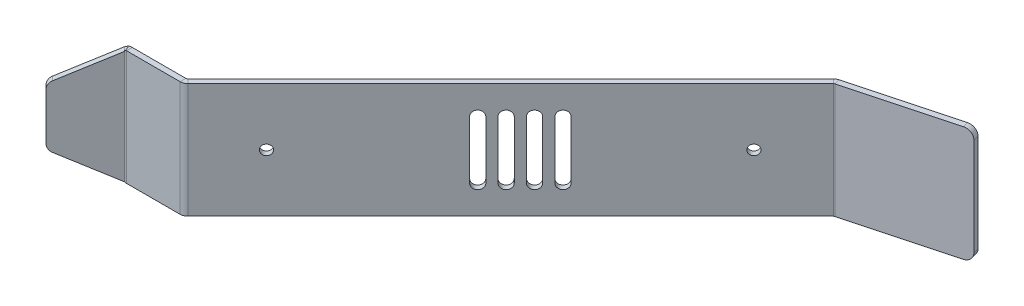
ISO-10303-21;
HEADER;
FILE_DESCRIPTION(('STEP AP214'),'2;1');
FILE_NAME('part.step','',(''),(''),'','','');
FILE_SCHEMA(('AUTOMOTIVE_DESIGN { 1 0 10303 214 1 1 1 1 }'));
ENDSEC;
DATA;
#1=APPLICATION_CONTEXT('core data for automotive mechanical design processes');
#2=APPLICATION_PROTOCOL_DEFINITION('international standard','automotive_design',2000,#1);
#3=PRODUCT_CONTEXT('',#1,'mechanical');
#4=PRODUCT('Part','Part','',(#3));
#5=PRODUCT_RELATED_PRODUCT_CATEGORY('part','',(#4));
#6=PRODUCT_DEFINITION_FORMATION('','',#4);
#7=PRODUCT_DEFINITION_CONTEXT('part definition',#1,'design');
#8=PRODUCT_DEFINITION('design','',#6,#7);
#9=PRODUCT_DEFINITION_SHAPE('','',#8);
#10=(LENGTH_UNIT() NAMED_UNIT(*) SI_UNIT(.MILLI.,.METRE.));
#11=(NAMED_UNIT(*) PLANE_ANGLE_UNIT() SI_UNIT($,.RADIAN.));
#12=(NAMED_UNIT(*) SI_UNIT($,.STERADIAN.) SOLID_ANGLE_UNIT());
#13=UNCERTAINTY_MEASURE_WITH_UNIT(LENGTH_MEASURE(1.E-05),#10,'distance_accuracy_value','');
#14=(GEOMETRIC_REPRESENTATION_CONTEXT(3) GLOBAL_UNCERTAINTY_ASSIGNED_CONTEXT((#13)) GLOBAL_UNIT_ASSIGNED_CONTEXT((#10,
#11,#12)) REPRESENTATION_CONTEXT('',''));
#15=CARTESIAN_POINT('',(0.,0.,0.));
#16=DIRECTION('',(0.,0.,1.));
#17=DIRECTION('',(1.,0.,0.));
#18=AXIS2_PLACEMENT_3D('',#15,#16,#17);
#19=CARTESIAN_POINT('',(14.6079368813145,28.1458980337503,27.8436387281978));
#20=DIRECTION('',(0.707106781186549,0.,0.707106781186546));
#21=DIRECTION('',(0.707106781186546,0.,-0.707106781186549));
#22=AXIS2_PLACEMENT_3D('',#19,#20,#21);
#23=PLANE('',#22);
#24=CARTESIAN_POINT('',(91.682576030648,30.,-49.231000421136));
#25=DIRECTION('',(0.707106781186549,0.,0.707106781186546));
#26=DIRECTION('',(0.707106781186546,0.,-0.707106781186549));
#27=AXIS2_PLACEMENT_3D('',#24,#25,#26);
#28=CIRCLE('',#27,2.);
#29=CARTESIAN_POINT('',(93.0967895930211,30.,-50.6452139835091));
#30=VERTEX_POINT('',#29);
#31=CARTESIAN_POINT('',(90.268362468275,30.,-47.8167868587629));
#32=VERTEX_POINT('',#31);
#33=EDGE_CURVE('E374',#30,#32,#28,.T.);
#34=ORIENTED_EDGE('',*,*,#33,.F.);
#35=DIRECTION('',(0.,1.,0.));
#36=VECTOR('',#35,1.);
#37=CARTESIAN_POINT('',(93.0967895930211,28.1458980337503,-50.6452139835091));
#38=LINE('',#37,#36);
#39=CARTESIAN_POINT('',(93.0967895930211,10.,-50.6452139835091));
#40=VERTEX_POINT('',#39);
#41=EDGE_CURVE('E382',#40,#30,#38,.T.);
#42=ORIENTED_EDGE('',*,*,#41,.F.);
#43=CARTESIAN_POINT('',(91.682576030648,10.,-49.231000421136));
#44=DIRECTION('',(0.707106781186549,0.,0.707106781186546));
#45=DIRECTION('',(0.707106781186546,0.,-0.707106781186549));
#46=AXIS2_PLACEMENT_3D('',#43,#44,#45);
#47=CIRCLE('',#46,2.);
#48=CARTESIAN_POINT('',(90.268362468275,10.,-47.8167868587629));
#49=VERTEX_POINT('',#48);
#50=EDGE_CURVE('E389',#49,#40,#47,.T.);
#51=ORIENTED_EDGE('',*,*,#50,.F.);
#52=DIRECTION('',(0.,-1.,0.));
#53=VECTOR('',#52,1.);
#54=CARTESIAN_POINT('',(90.268362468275,28.1458980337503,-47.8167868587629));
#55=LINE('',#54,#53);
#56=EDGE_CURVE('E397',#32,#49,#55,.T.);
#57=ORIENTED_EDGE('',*,*,#56,.F.);
#58=EDGE_LOOP('',(#34,#42,#51,#57));
#59=FACE_BOUND('',#58,.T.);
#60=CARTESIAN_POINT('',(96.6323234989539,30.,-54.1807478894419));
#61=DIRECTION('',(0.707106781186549,0.,0.707106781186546));
#62=DIRECTION('',(0.707106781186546,0.,-0.707106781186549));
#63=AXIS2_PLACEMENT_3D('',#60,#61,#62);
#64=CIRCLE('',#63,2.);
#65=CARTESIAN_POINT('',(98.046537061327,30.,-55.594961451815));
#66=VERTEX_POINT('',#65);
#67=CARTESIAN_POINT('',(95.2181099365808,30.,-52.7665343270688));
#68=VERTEX_POINT('',#67);
#69=EDGE_CURVE('E403',#66,#68,#64,.T.);
#70=ORIENTED_EDGE('',*,*,#69,.F.);
#71=DIRECTION('',(0.,1.,0.));
#72=VECTOR('',#71,1.);
#73=CARTESIAN_POINT('',(98.046537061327,28.1458980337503,-55.594961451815));
#74=LINE('',#73,#72);
#75=CARTESIAN_POINT('',(98.046537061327,10.,-55.594961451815));
#76=VERTEX_POINT('',#75);
#77=EDGE_CURVE('E411',#76,#66,#74,.T.);
#78=ORIENTED_EDGE('',*,*,#77,.F.);
#79=CARTESIAN_POINT('',(96.6323234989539,10.,-54.1807478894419));
#80=DIRECTION('',(0.707106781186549,0.,0.707106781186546));
#81=DIRECTION('',(0.707106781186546,0.,-0.707106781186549));
#82=AXIS2_PLACEMENT_3D('',#79,#80,#81);
#83=CIRCLE('',#82,2.);
#84=CARTESIAN_POINT('',(95.2181099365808,10.,-52.7665343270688));
#85=VERTEX_POINT('',#84);
#86=EDGE_CURVE('E418',#85,#76,#83,.T.);
#87=ORIENTED_EDGE('',*,*,#86,.F.);
#88=DIRECTION('',(0.,-1.,0.));
#89=VECTOR('',#88,1.);
#90=CARTESIAN_POINT('',(95.2181099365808,28.1458980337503,-52.7665343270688));
#91=LINE('',#90,#89);
#92=EDGE_CURVE('E426',#68,#85,#91,.T.);
#93=ORIENTED_EDGE('',*,*,#92,.F.);
#94=EDGE_LOOP('',(#70,#78,#87,#93));
#95=FACE_BOUND('',#94,.T.);
#96=CARTESIAN_POINT('',(101.58207096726,30.,-59.1304953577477));
#97=DIRECTION('',(0.707106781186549,0.,0.707106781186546));
#98=DIRECTION('',(0.707106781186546,0.,-0.707106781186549));
#99=AXIS2_PLACEMENT_3D('',#96,#97,#98);
#100=CIRCLE('',#99,2.);
#101=CARTESIAN_POINT('',(102.996284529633,30.,-60.5447089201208));
#102=VERTEX_POINT('',#101);
#103=CARTESIAN_POINT('',(100.167857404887,30.,-57.7162817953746));
#104=VERTEX_POINT('',#103);
#105=EDGE_CURVE('E432',#102,#104,#100,.T.);
#106=ORIENTED_EDGE('',*,*,#105,.F.);
#107=DIRECTION('',(0.,1.,0.));
#108=VECTOR('',#107,1.);
#109=CARTESIAN_POINT('',(102.996284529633,28.1458980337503,-60.5447089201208));
#110=LINE('',#109,#108);
#111=CARTESIAN_POINT('',(102.996284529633,10.,-60.5447089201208));
#112=VERTEX_POINT('',#111);
#113=EDGE_CURVE('E440',#112,#102,#110,.T.);
#114=ORIENTED_EDGE('',*,*,#113,.F.);
#115=CARTESIAN_POINT('',(101.58207096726,10.,-59.1304953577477));
#116=DIRECTION('',(0.707106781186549,0.,0.707106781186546));
#117=DIRECTION('',(0.707106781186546,0.,-0.707106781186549));
#118=AXIS2_PLACEMENT_3D('',#115,#116,#117);
#119=CIRCLE('',#118,2.);
#120=CARTESIAN_POINT('',(100.167857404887,10.,-57.7162817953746));
#121=VERTEX_POINT('',#120);
#122=EDGE_CURVE('E447',#121,#112,#119,.T.);
#123=ORIENTED_EDGE('',*,*,#122,.F.);
#124=DIRECTION('',(0.,-1.,0.));
#125=VECTOR('',#124,1.);
#126=CARTESIAN_POINT('',(100.167857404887,28.1458980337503,-57.7162817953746));
#127=LINE('',#126,#125);
#128=EDGE_CURVE('E455',#104,#121,#127,.T.);
#129=ORIENTED_EDGE('',*,*,#128,.F.);
#130=EDGE_LOOP('',(#106,#114,#123,#129));
#131=FACE_BOUND('',#130,.T.);
#132=CARTESIAN_POINT('',(106.531818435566,30.,-64.0802428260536));
#133=DIRECTION('',(0.707106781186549,0.,0.707106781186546));
#134=DIRECTION('',(0.707106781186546,0.,-0.707106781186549));
#135=AXIS2_PLACEMENT_3D('',#132,#133,#134);
#136=CIRCLE('',#135,2.);
#137=CARTESIAN_POINT('',(107.946031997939,30.,-65.4944563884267));
#138=VERTEX_POINT('',#137);
#139=CARTESIAN_POINT('',(105.117604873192,30.,-62.6660292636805));
#140=VERTEX_POINT('',#139);
#141=EDGE_CURVE('E461',#138,#140,#136,.T.);
#142=ORIENTED_EDGE('',*,*,#141,.F.);
#143=DIRECTION('',(0.,1.,0.));
#144=VECTOR('',#143,1.);
#145=CARTESIAN_POINT('',(107.946031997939,28.1458980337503,-65.4944563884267));
#146=LINE('',#145,#144);
#147=CARTESIAN_POINT('',(107.946031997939,10.,-65.4944563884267));
#148=VERTEX_POINT('',#147);
#149=EDGE_CURVE('E469',#148,#138,#146,.T.);
#150=ORIENTED_EDGE('',*,*,#149,.F.);
#151=CARTESIAN_POINT('',(106.531818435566,10.,-64.0802428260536));
#152=DIRECTION('',(0.707106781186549,0.,0.707106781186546));
#153=DIRECTION('',(0.707106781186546,0.,-0.707106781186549));
#154=AXIS2_PLACEMENT_3D('',#151,#152,#153);
#155=CIRCLE('',#154,2.);
#156=CARTESIAN_POINT('',(105.117604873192,10.,-62.6660292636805));
#157=VERTEX_POINT('',#156);
#158=EDGE_CURVE('E476',#157,#148,#155,.T.);
#159=ORIENTED_EDGE('',*,*,#158,.F.);
#160=DIRECTION('',(0.,-1.,0.));
#161=VECTOR('',#160,1.);
#162=CARTESIAN_POINT('',(105.117604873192,28.1458980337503,-62.6660292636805));
#163=LINE('',#162,#161);
#164=EDGE_CURVE('E484',#140,#157,#163,.T.);
#165=ORIENTED_EDGE('',*,*,#164,.F.);
#166=EDGE_LOOP('',(#142,#150,#159,#165));
#167=FACE_BOUND('',#166,.T.);
#168=CARTESIAN_POINT('',(54.9130234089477,20.,-12.4614477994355));
#169=DIRECTION('',(0.707106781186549,0.,0.707106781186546));
#170=DIRECTION('',(0.707106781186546,0.,-0.707106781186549));
#171=AXIS2_PLACEMENT_3D('',#168,#169,#170);
#172=CIRCLE('',#171,1.75);
#173=CARTESIAN_POINT('',(56.1504602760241,20.,-13.698884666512));
#174=VERTEX_POINT('',#173);
#175=EDGE_CURVE('E486',#174,#174,#172,.T.);
#176=ORIENTED_EDGE('',*,*,#175,.F.);
#177=EDGE_LOOP('',(#176));
#178=FACE_BOUND('',#177,.T.);
#179=CARTESIAN_POINT('',(139.765837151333,20.,-97.3142615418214));
#180=DIRECTION('',(0.707106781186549,0.,0.707106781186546));
#181=DIRECTION('',(0.707106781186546,0.,-0.707106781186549));
#182=AXIS2_PLACEMENT_3D('',#179,#180,#181);
#183=CIRCLE('',#182,1.75000000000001);
#184=CARTESIAN_POINT('',(141.00327401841,20.,-98.5516984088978));
#185=VERTEX_POINT('',#184);
#186=EDGE_CURVE('E489',#185,#185,#183,.T.);
#187=ORIENTED_EDGE('',*,*,#186,.F.);
#188=EDGE_LOOP('',(#187));
#189=FACE_BOUND('',#188,.T.);
#190=DIRECTION('',(0.707106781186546,0.,-0.707106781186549));
#191=VECTOR('',#190,1.);
#192=CARTESIAN_POINT('',(26.6287521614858,0.,15.8228234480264));
#193=LINE('',#192,#191);
#194=CARTESIAN_POINT('',(41.2531071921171,0.,1.1984684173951));
#195=VERTEX_POINT('',#194);
#196=CARTESIAN_POINT('',(153.586493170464,0.,-111.134917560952));
#197=VERTEX_POINT('',#196);
#198=EDGE_CURVE('E63',#195,#197,#193,.T.);
#199=ORIENTED_EDGE('',*,*,#198,.T.);
#200=DIRECTION('',(0.,1.,0.));
#201=VECTOR('',#200,1.);
#202=CARTESIAN_POINT('',(153.586493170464,28.1458980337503,-111.134917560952));
#203=LINE('',#202,#201);
#204=CARTESIAN_POINT('',(153.586493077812,40.,-111.134917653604));
#205=VERTEX_POINT('',#204);
#206=EDGE_CURVE('E768',#197,#205,#203,.T.);
#207=ORIENTED_EDGE('',*,*,#206,.T.);
#208=DIRECTION('',(-0.707106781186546,0.,0.707106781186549));
#209=VECTOR('',#208,1.);
#210=CARTESIAN_POINT('',(26.6287521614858,40.,15.8228234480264));
#211=LINE('',#210,#209);
#212=CARTESIAN_POINT('',(41.2531072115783,40.,1.19846843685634));
#213=VERTEX_POINT('',#212);
#214=EDGE_CURVE('E369',#205,#213,#211,.T.);
#215=ORIENTED_EDGE('',*,*,#214,.T.);
#216=DIRECTION('',(0.,-1.,0.));
#217=VECTOR('',#216,1.);
#218=CARTESIAN_POINT('',(41.2531071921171,28.1458980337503,1.1984684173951));
#219=LINE('',#218,#217);
#220=EDGE_CURVE('E367',#213,#195,#219,.T.);
#221=ORIENTED_EDGE('',*,*,#220,.T.);
#222=EDGE_LOOP('',(#199,#207,#215,#221));
#223=FACE_BOUND('',#222,.T.);
#224=ADVANCED_FACE('F59',(#59,#95,#131,#167,#178,#189,#223),#23,.T.);
#225=CARTESIAN_POINT('',(20.,40.,2.));
#226=DIRECTION('',(0.,-1.,0.));
#227=DIRECTION('',(0.,0.,-1.));
#228=AXIS2_PLACEMENT_3D('',#225,#226,#227);
#229=PLANE('',#228);
#230=DIRECTION('',(-1.,0.,0.));
#231=VECTOR('',#230,1.);
#232=CARTESIAN_POINT('',(20.,40.,2.));
#233=LINE('',#232,#231);
#234=CARTESIAN_POINT('',(39.318038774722,40.,2.0000000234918));
#235=VERTEX_POINT('',#234);
#236=CARTESIAN_POINT('',(20.681961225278,40.,2.00000001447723));
#237=VERTEX_POINT('',#236);
#238=EDGE_CURVE('E662',#235,#237,#233,.T.);
#239=ORIENTED_EDGE('',*,*,#238,.F.);
#240=DIRECTION('',(0.,0.,-1.));
#241=VECTOR('',#240,1.);
#242=CARTESIAN_POINT('',(39.318038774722,40.,2.));
#243=LINE('',#242,#241);
#244=CARTESIAN_POINT('',(39.318038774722,40.,0.));
#245=VERTEX_POINT('',#244);
#246=EDGE_CURVE('E765',#235,#245,#243,.T.);
#247=ORIENTED_EDGE('',*,*,#246,.T.);
#248=DIRECTION('',(-1.,0.,0.));
#249=VECTOR('',#248,1.);
#250=CARTESIAN_POINT('',(20.,40.,0.));
#251=LINE('',#250,#249);
#252=CARTESIAN_POINT('',(20.681961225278,40.,1.4477228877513E-08));
#253=VERTEX_POINT('',#252);
#254=EDGE_CURVE('E654',#245,#253,#251,.T.);
#255=ORIENTED_EDGE('',*,*,#254,.T.);
#256=DIRECTION('',(0.,0.,1.));
#257=VECTOR('',#256,1.);
#258=CARTESIAN_POINT('',(20.681961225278,40.,2.));
#259=LINE('',#258,#257);
#260=EDGE_CURVE('E645',#253,#237,#259,.T.);
#261=ORIENTED_EDGE('',*,*,#260,.T.);
#262=EDGE_LOOP('',(#239,#247,#255,#261));
#263=FACE_BOUND('',#262,.T.);
#264=ADVANCED_FACE('F800',(#263),#229,.F.);
#265=CARTESIAN_POINT('',(3.,28.1458980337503,0.));
#266=DIRECTION('',(0.,0.,1.));
#267=DIRECTION('',(1.,0.,0.));
#268=AXIS2_PLACEMENT_3D('',#265,#266,#267);
#269=PLANE('',#268);
#270=ORIENTED_EDGE('',*,*,#254,.F.);
#271=DIRECTION('',(0.,-1.,0.));
#272=VECTOR('',#271,1.);
#273=CARTESIAN_POINT('',(39.318038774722,28.1458980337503,0.));
#274=LINE('',#273,#272);
#275=CARTESIAN_POINT('',(39.318038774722,0.,2.75223537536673E-08));
#276=VERTEX_POINT('',#275);
#277=EDGE_CURVE('E762',#245,#276,#274,.T.);
#278=ORIENTED_EDGE('',*,*,#277,.T.);
#279=DIRECTION('',(1.,0.,0.));
#280=VECTOR('',#279,1.);
#281=CARTESIAN_POINT('',(20.,0.,0.));
#282=LINE('',#281,#280);
#283=CARTESIAN_POINT('',(20.681961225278,0.,0.));
#284=VERTEX_POINT('',#283);
#285=EDGE_CURVE('E658',#284,#276,#282,.T.);
#286=ORIENTED_EDGE('',*,*,#285,.F.);
#287=DIRECTION('',(0.,1.,0.));
#288=VECTOR('',#287,1.);
#289=CARTESIAN_POINT('',(20.681961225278,28.1458980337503,0.));
#290=LINE('',#289,#288);
#291=EDGE_CURVE('E655',#284,#253,#290,.T.);
#292=ORIENTED_EDGE('',*,*,#291,.T.);
#293=EDGE_LOOP('',(#270,#278,#286,#292));
#294=FACE_BOUND('',#293,.T.);
#295=ADVANCED_FACE('F813',(#294),#269,.F.);
#296=CARTESIAN_POINT('',(20.,0.,2.));
#297=DIRECTION('',(0.,1.,0.));
#298=DIRECTION('',(0.,0.,1.));
#299=AXIS2_PLACEMENT_3D('',#296,#297,#298);
#300=PLANE('',#299);
#301=ORIENTED_EDGE('',*,*,#285,.T.);
#302=DIRECTION('',(0.,0.,1.));
#303=VECTOR('',#302,1.);
#304=CARTESIAN_POINT('',(39.318038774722,0.,2.));
#305=LINE('',#304,#303);
#306=CARTESIAN_POINT('',(39.318038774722,0.,2.00000002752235));
#307=VERTEX_POINT('',#306);
#308=EDGE_CURVE('E758',#276,#307,#305,.T.);
#309=ORIENTED_EDGE('',*,*,#308,.T.);
#310=DIRECTION('',(1.,0.,0.));
#311=VECTOR('',#310,1.);
#312=CARTESIAN_POINT('',(20.,0.,2.));
#313=LINE('',#312,#311);
#314=CARTESIAN_POINT('',(20.681961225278,0.,2.00000001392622));
#315=VERTEX_POINT('',#314);
#316=EDGE_CURVE('E666',#315,#307,#313,.T.);
#317=ORIENTED_EDGE('',*,*,#316,.F.);
#318=DIRECTION('',(0.,0.,-1.));
#319=VECTOR('',#318,1.);
#320=CARTESIAN_POINT('',(20.681961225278,0.,2.));
#321=LINE('',#320,#319);
#322=EDGE_CURVE('E659',#315,#284,#321,.T.);
#323=ORIENTED_EDGE('',*,*,#322,.T.);
#324=EDGE_LOOP('',(#301,#309,#317,#323));
#325=FACE_BOUND('',#324,.T.);
#326=ADVANCED_FACE('F815',(#325),#300,.F.);
#327=CARTESIAN_POINT('',(8.62251049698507,28.1458980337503,13.754341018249));
#328=DIRECTION('',(0.707106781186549,0.,0.707106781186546));
#329=DIRECTION('',(0.707106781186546,0.,-0.707106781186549));
#330=AXIS2_PLACEMENT_3D('',#327,#328,#329);
#331=PLANE('',#330);
#332=DIRECTION('',(0.632455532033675,-0.447213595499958,-0.632455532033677));
#333=VECTOR('',#332,1.);
#334=CARTESIAN_POINT('',(7.67382719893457,9.17082039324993,14.7030243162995));
#335=LINE('',#334,#333);
#336=CARTESIAN_POINT('',(7.67382719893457,9.17082039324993,14.7030243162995));
#337=VERTEX_POINT('',#336);
#338=CARTESIAN_POINT('',(20.1611063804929,0.340980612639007,2.21574515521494));
#339=VERTEX_POINT('',#338);
#340=EDGE_CURVE('E683',#337,#339,#335,.T.);
#341=ORIENTED_EDGE('',*,*,#340,.T.);
#342=DIRECTION('',(0.,1.,0.));
#343=VECTOR('',#342,1.);
#344=CARTESIAN_POINT('',(20.161106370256,28.1458980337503,2.21574514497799));
#345=LINE('',#344,#343);
#346=CARTESIAN_POINT('',(20.161106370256,39.659019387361,2.21574514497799));
#347=VERTEX_POINT('',#346);
#348=EDGE_CURVE('E697',#339,#347,#345,.T.);
#349=ORIENTED_EDGE('',*,*,#348,.T.);
#350=DIRECTION('',(-0.632455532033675,-0.447213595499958,0.632455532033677));
#351=VECTOR('',#350,1.);
#352=CARTESIAN_POINT('',(7.67382719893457,30.8291796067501,14.7030243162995));
#353=LINE('',#352,#351);
#354=CARTESIAN_POINT('',(7.67382719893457,30.8291796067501,14.7030243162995));
#355=VERTEX_POINT('',#354);
#356=EDGE_CURVE('E688',#347,#355,#353,.T.);
#357=ORIENTED_EDGE('',*,*,#356,.T.);
#358=CARTESIAN_POINT('',(8.62251049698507,28.1458980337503,13.754341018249));
#359=DIRECTION('',(0.707106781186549,0.,0.707106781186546));
#360=DIRECTION('',(0.707106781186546,0.,-0.707106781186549));
#361=AXIS2_PLACEMENT_3D('',#358,#359,#360);
#362=CIRCLE('',#361,3.);
#363=CARTESIAN_POINT('',(6.50119015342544,28.1458980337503,15.8756613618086));
#364=VERTEX_POINT('',#363);
#365=EDGE_CURVE('E675',#355,#364,#362,.T.);
#366=ORIENTED_EDGE('',*,*,#365,.T.);
#367=DIRECTION('',(0.,-1.,0.));
#368=VECTOR('',#367,1.);
#369=CARTESIAN_POINT('',(6.50119015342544,11.8541019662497,15.8756613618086));
#370=LINE('',#369,#368);
#371=CARTESIAN_POINT('',(6.50119015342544,11.8541019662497,15.8756613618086));
#372=VERTEX_POINT('',#371);
#373=EDGE_CURVE('E678',#364,#372,#370,.T.);
#374=ORIENTED_EDGE('',*,*,#373,.T.);
#375=CARTESIAN_POINT('',(8.62251049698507,11.8541019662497,13.754341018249));
#376=DIRECTION('',(0.707106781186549,0.,0.707106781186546));
#377=DIRECTION('',(-0.707106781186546,0.,0.707106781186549));
#378=AXIS2_PLACEMENT_3D('',#375,#376,#377);
#379=CIRCLE('',#378,3.);
#380=EDGE_CURVE('E681',#372,#337,#379,.T.);
#381=ORIENTED_EDGE('',*,*,#380,.T.);
#382=EDGE_LOOP('',(#341,#349,#357,#366,#374,#381));
#383=FACE_BOUND('',#382,.T.);
#384=ADVANCED_FACE('F731',(#383),#331,.T.);
#385=CARTESIAN_POINT('',(7.20829693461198,28.1458980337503,12.3401274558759));
#386=DIRECTION('',(0.707106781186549,0.,0.707106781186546));
#387=DIRECTION('',(0.707106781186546,0.,-0.707106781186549));
#388=AXIS2_PLACEMENT_3D('',#385,#386,#387);
#389=PLANE('',#388);
#390=DIRECTION('',(0.,1.,0.));
#391=VECTOR('',#390,1.);
#392=CARTESIAN_POINT('',(18.7468928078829,28.1458980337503,0.801531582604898));
#393=LINE('',#392,#391);
#394=CARTESIAN_POINT('',(18.7468928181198,0.340980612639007,0.801531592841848));
#395=VERTEX_POINT('',#394);
#396=CARTESIAN_POINT('',(18.7468928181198,39.659019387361,0.801531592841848));
#397=VERTEX_POINT('',#396);
#398=EDGE_CURVE('E851',#395,#397,#393,.T.);
#399=ORIENTED_EDGE('',*,*,#398,.F.);
#400=DIRECTION('',(0.632455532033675,-0.447213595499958,-0.632455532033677));
#401=VECTOR('',#400,1.);
#402=CARTESIAN_POINT('',(6.25961363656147,9.17082039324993,13.2888107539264));
#403=LINE('',#402,#401);
#404=CARTESIAN_POINT('',(6.25961363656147,9.17082039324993,13.2888107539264));
#405=VERTEX_POINT('',#404);
#406=EDGE_CURVE('E674',#405,#395,#403,.T.);
#407=ORIENTED_EDGE('',*,*,#406,.F.);
#408=CARTESIAN_POINT('',(7.20829693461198,11.8541019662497,12.3401274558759));
#409=DIRECTION('',(0.707106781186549,0.,0.707106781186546));
#410=DIRECTION('',(-0.707106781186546,0.,0.707106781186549));
#411=AXIS2_PLACEMENT_3D('',#408,#409,#410);
#412=CIRCLE('',#411,3.);
#413=CARTESIAN_POINT('',(5.08697659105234,11.8541019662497,14.4614477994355));
#414=VERTEX_POINT('',#413);
#415=EDGE_CURVE('E672',#414,#405,#412,.T.);
#416=ORIENTED_EDGE('',*,*,#415,.F.);
#417=DIRECTION('',(0.,-1.,0.));
#418=VECTOR('',#417,1.);
#419=CARTESIAN_POINT('',(5.08697659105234,11.8541019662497,14.4614477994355));
#420=LINE('',#419,#418);
#421=CARTESIAN_POINT('',(5.08697659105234,28.1458980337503,14.4614477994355));
#422=VERTEX_POINT('',#421);
#423=EDGE_CURVE('E670',#422,#414,#420,.T.);
#424=ORIENTED_EDGE('',*,*,#423,.F.);
#425=CARTESIAN_POINT('',(7.20829693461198,28.1458980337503,12.3401274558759));
#426=DIRECTION('',(0.707106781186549,0.,0.707106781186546));
#427=DIRECTION('',(0.707106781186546,0.,-0.707106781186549));
#428=AXIS2_PLACEMENT_3D('',#425,#426,#427);
#429=CIRCLE('',#428,3.);
#430=CARTESIAN_POINT('',(6.25961363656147,30.8291796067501,13.2888107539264));
#431=VERTEX_POINT('',#430);
#432=EDGE_CURVE('E653',#431,#422,#429,.T.);
#433=ORIENTED_EDGE('',*,*,#432,.F.);
#434=DIRECTION('',(-0.632455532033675,-0.447213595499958,0.632455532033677));
#435=VECTOR('',#434,1.);
#436=CARTESIAN_POINT('',(6.25961363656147,30.8291796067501,13.2888107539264));
#437=LINE('',#436,#435);
#438=EDGE_CURVE('E679',#397,#431,#437,.T.);
#439=ORIENTED_EDGE('',*,*,#438,.F.);
#440=EDGE_LOOP('',(#399,#407,#416,#424,#433,#439));
#441=FACE_BOUND('',#440,.T.);
#442=ADVANCED_FACE('F733',(#441),#389,.F.);
#443=CARTESIAN_POINT('',(8.62251049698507,28.1458980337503,13.754341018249));
#444=DIRECTION('',(-0.707106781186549,0.,-0.707106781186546));
#445=DIRECTION('',(-0.707106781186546,0.,0.707106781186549));
#446=AXIS2_PLACEMENT_3D('',#443,#444,#445);
#447=CYLINDRICAL_SURFACE('',#446,3.);
#448=ORIENTED_EDGE('',*,*,#432,.T.);
#449=DIRECTION('',(-0.707106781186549,0.,-0.707106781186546));
#450=VECTOR('',#449,1.);
#451=CARTESIAN_POINT('',(6.50119015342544,28.1458980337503,15.8756613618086));
#452=LINE('',#451,#450);
#453=EDGE_CURVE('E694',#364,#422,#452,.T.);
#454=ORIENTED_EDGE('',*,*,#453,.F.);
#455=ORIENTED_EDGE('',*,*,#365,.F.);
#456=DIRECTION('',(-0.707106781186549,0.,-0.707106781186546));
#457=VECTOR('',#456,1.);
#458=CARTESIAN_POINT('',(7.67382719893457,30.8291796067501,14.7030243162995));
#459=LINE('',#458,#457);
#460=EDGE_CURVE('E684',#355,#431,#459,.T.);
#461=ORIENTED_EDGE('',*,*,#460,.T.);
#462=EDGE_LOOP('',(#448,#454,#455,#461));
#463=FACE_BOUND('',#462,.T.);
#464=ADVANCED_FACE('F736',(#463),#447,.T.);
#465=CARTESIAN_POINT('',(6.50119015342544,11.8541019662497,15.8756613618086));
#466=DIRECTION('',(0.707106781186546,0.,-0.707106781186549));
#467=DIRECTION('',(-0.707106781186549,0.,-0.707106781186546));
#468=AXIS2_PLACEMENT_3D('',#465,#466,#467);
#469=PLANE('',#468);
#470=ORIENTED_EDGE('',*,*,#423,.T.);
#471=DIRECTION('',(-0.707106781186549,0.,-0.707106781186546));
#472=VECTOR('',#471,1.);
#473=CARTESIAN_POINT('',(6.50119015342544,11.8541019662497,15.8756613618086));
#474=LINE('',#473,#472);
#475=EDGE_CURVE('E691',#372,#414,#474,.T.);
#476=ORIENTED_EDGE('',*,*,#475,.F.);
#477=ORIENTED_EDGE('',*,*,#373,.F.);
#478=ORIENTED_EDGE('',*,*,#453,.T.);
#479=EDGE_LOOP('',(#470,#476,#477,#478));
#480=FACE_BOUND('',#479,.T.);
#481=ADVANCED_FACE('F869',(#480),#469,.F.);
#482=CARTESIAN_POINT('',(8.62251049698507,11.8541019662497,13.754341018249));
#483=DIRECTION('',(-0.707106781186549,0.,-0.707106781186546));
#484=DIRECTION('',(-0.707106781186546,0.,0.707106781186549));
#485=AXIS2_PLACEMENT_3D('',#482,#483,#484);
#486=CYLINDRICAL_SURFACE('',#485,3.);
#487=ORIENTED_EDGE('',*,*,#415,.T.);
#488=DIRECTION('',(-0.707106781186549,0.,-0.707106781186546));
#489=VECTOR('',#488,1.);
#490=CARTESIAN_POINT('',(7.67382719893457,9.17082039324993,14.7030243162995));
#491=LINE('',#490,#489);
#492=EDGE_CURVE('E687',#337,#405,#491,.T.);
#493=ORIENTED_EDGE('',*,*,#492,.F.);
#494=ORIENTED_EDGE('',*,*,#380,.F.);
#495=ORIENTED_EDGE('',*,*,#475,.T.);
#496=EDGE_LOOP('',(#487,#493,#494,#495));
#497=FACE_BOUND('',#496,.T.);
#498=ADVANCED_FACE('F605',(#497),#486,.T.);
#499=CARTESIAN_POINT('',(7.67382719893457,9.17082039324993,14.7030243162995));
#500=DIRECTION('',(0.316227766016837,0.894427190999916,-0.316227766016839));
#501=DIRECTION('',(-0.632455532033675,0.447213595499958,0.632455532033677));
#502=AXIS2_PLACEMENT_3D('',#499,#500,#501);
#503=PLANE('',#502);
#504=CARTESIAN_POINT('',(20.1611063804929,0.340980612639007,2.21574515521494));
#505=CARTESIAN_POINT('',(18.7468928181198,0.340980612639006,0.801531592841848));
#506=B_SPLINE_CURVE_WITH_KNOTS('',1,(#504,#505),.UNSPECIFIED.,.F.,.F.,(2,2),(0.,1.),.UNSPECIFIED.);
#507=EDGE_CURVE('E700',#339,#395,#506,.T.);
#508=ORIENTED_EDGE('',*,*,#507,.F.);
#509=ORIENTED_EDGE('',*,*,#340,.F.);
#510=ORIENTED_EDGE('',*,*,#492,.T.);
#511=ORIENTED_EDGE('',*,*,#406,.T.);
#512=EDGE_LOOP('',(#508,#509,#510,#511));
#513=FACE_BOUND('',#512,.T.);
#514=ADVANCED_FACE('F720',(#513),#503,.F.);
#515=CARTESIAN_POINT('',(7.67382719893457,30.8291796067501,14.7030243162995));
#516=DIRECTION('',(0.316227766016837,-0.894427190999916,-0.316227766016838));
#517=DIRECTION('',(0.632455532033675,0.447213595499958,-0.632455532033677));
#518=AXIS2_PLACEMENT_3D('',#515,#516,#517);
#519=PLANE('',#518);
#520=CARTESIAN_POINT('',(18.7468928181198,39.659019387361,0.801531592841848));
#521=CARTESIAN_POINT('',(20.1611063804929,39.659019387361,2.21574515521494));
#522=B_SPLINE_CURVE_WITH_KNOTS('',1,(#520,#521),.UNSPECIFIED.,.F.,.F.,(2,2),(0.,1.),.UNSPECIFIED.);
#523=EDGE_CURVE('E759',#397,#347,#522,.T.);
#524=ORIENTED_EDGE('',*,*,#523,.F.);
#525=ORIENTED_EDGE('',*,*,#438,.T.);
#526=ORIENTED_EDGE('',*,*,#460,.F.);
#527=ORIENTED_EDGE('',*,*,#356,.F.);
#528=EDGE_LOOP('',(#524,#525,#526,#527));
#529=FACE_BOUND('',#528,.T.);
#530=ADVANCED_FACE('F730',(#529),#519,.F.);
#531=CARTESIAN_POINT('',(3.,28.1458980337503,2.));
#532=DIRECTION('',(0.,0.,1.));
#533=DIRECTION('',(1.,0.,0.));
#534=AXIS2_PLACEMENT_3D('',#531,#532,#533);
#535=PLANE('',#534);
#536=DIRECTION('',(0.,-1.,0.));
#537=VECTOR('',#536,1.);
#538=CARTESIAN_POINT('',(39.318038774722,28.1458980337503,2.));
#539=LINE('',#538,#537);
#540=EDGE_CURVE('E751',#235,#307,#539,.T.);
#541=ORIENTED_EDGE('',*,*,#540,.F.);
#542=ORIENTED_EDGE('',*,*,#238,.T.);
#543=DIRECTION('',(0.,1.,0.));
#544=VECTOR('',#543,1.);
#545=CARTESIAN_POINT('',(20.681961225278,28.1458980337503,2.));
#546=LINE('',#545,#544);
#547=EDGE_CURVE('E663',#315,#237,#546,.T.);
#548=ORIENTED_EDGE('',*,*,#547,.F.);
#549=ORIENTED_EDGE('',*,*,#316,.T.);
#550=EDGE_LOOP('',(#541,#542,#548,#549));
#551=FACE_BOUND('',#550,.T.);
#552=ADVANCED_FACE('F741',(#551),#535,.T.);
#553=CARTESIAN_POINT('',(18.7468928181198,0.340980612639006,0.801531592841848));
#554=CARTESIAN_POINT('',(19.0003305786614,0.227258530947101,0.548093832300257));
#555=CARTESIAN_POINT('',(19.3035773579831,0.1137220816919,0.345470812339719));
#556=CARTESIAN_POINT('',(19.6347097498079,0.,0.20831128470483));
#557=CARTESIAN_POINT('',(20.1611063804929,0.340980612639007,2.21574515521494));
#558=CARTESIAN_POINT('',(20.2293049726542,0.227288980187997,2.14754656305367));
#559=CARTESIAN_POINT('',(20.3109708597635,0.11369163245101,2.09297916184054));
#560=CARTESIAN_POINT('',(20.4000766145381,0.,2.0560703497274));
#561=B_SPLINE_SURFACE_WITH_KNOTS('',1,3,((#553,#554,#555,#556),(#557,#558,#559,#560)),
.UNSPECIFIED.,.F.,.F.,.F.,(2,2),(4,4),(0.,1.),(0.,1.),.UNSPECIFIED.);
#562=CARTESIAN_POINT('',(18.7468928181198,0.340980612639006,0.801531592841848));
#563=CARTESIAN_POINT('',(19.0003305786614,0.227258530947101,0.548093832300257));
#564=CARTESIAN_POINT('',(19.3035773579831,0.1137220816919,0.345470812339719));
#565=CARTESIAN_POINT('',(19.6347097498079,0.,0.20831128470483));
#566=B_SPLINE_CURVE_WITH_KNOTS('',3,(#562,#563,#564,#565),.UNSPECIFIED.,.F.,.F.,(4,4),(0.,1.),.UNSPECIFIED.);
#567=CARTESIAN_POINT('',(19.6347097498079,0.,0.20831128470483));
#568=VERTEX_POINT('',#567);
#569=EDGE_CURVE('E511',#395,#568,#566,.T.);
#570=CARTESIAN_POINT('',(19.6347097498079,0.,0.20831128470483));
#571=CARTESIAN_POINT('',(20.4000766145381,0.,2.0560703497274));
#572=B_SPLINE_CURVE_WITH_KNOTS('',1,(#570,#571),.UNSPECIFIED.,.F.,.F.,(2,2),(0.,1.),.UNSPECIFIED.);
#573=CARTESIAN_POINT('',(20.4000766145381,0.,2.0560703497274));
#574=VERTEX_POINT('',#573);
#575=EDGE_CURVE('E667',#568,#574,#572,.T.);
#576=CARTESIAN_POINT('',(20.4000766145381,0.,2.0560703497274));
#577=CARTESIAN_POINT('',(20.3109708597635,0.11369163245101,2.09297916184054));
#578=CARTESIAN_POINT('',(20.2293049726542,0.227288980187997,2.14754656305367));
#579=CARTESIAN_POINT('',(20.1611063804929,0.340980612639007,2.21574515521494));
#580=B_SPLINE_CURVE_WITH_KNOTS('',3,(#576,#577,#578,#579),.UNSPECIFIED.,.F.,.F.,(4,4),(0.,1.),.UNSPECIFIED.);
#581=EDGE_CURVE('E835',#339,#574,#580,.F.);
#582=ORIENTED_EDGE('',*,*,#507,.T.);
#583=ORIENTED_EDGE('',*,*,#569,.T.);
#584=ORIENTED_EDGE('',*,*,#575,.T.);
#585=ORIENTED_EDGE('',*,*,#581,.F.);
#586=EDGE_LOOP('',(#582,#583,#584,#585));
#587=FACE_BOUND('',#586,.T.);
#588=ADVANCED_FACE('F601',(#587),#561,.F.);
#589=CARTESIAN_POINT('',(20.681961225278,0.,2.73659998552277));
#590=DIRECTION('',(0.,1.,0.));
#591=DIRECTION('',(-1.,0.,0.));
#592=AXIS2_PLACEMENT_3D('',#589,#590,#591);
#593=PLANE('',#592);
#594=ORIENTED_EDGE('',*,*,#575,.F.);
#595=CARTESIAN_POINT('',(20.681961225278,0.,2.7366));
#596=DIRECTION('',(0.,-1.,0.));
#597=DIRECTION('',(1.,0.,0.));
#598=AXIS2_PLACEMENT_3D('',#595,#596,#597);
#599=CIRCLE('',#598,2.73659998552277);
#600=EDGE_CURVE('E512',#568,#284,#599,.T.);
#601=ORIENTED_EDGE('',*,*,#600,.T.);
#602=ORIENTED_EDGE('',*,*,#322,.F.);
#603=CARTESIAN_POINT('',(20.681961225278,0.,2.73659998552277));
#604=DIRECTION('',(0.,-1.,0.));
#605=DIRECTION('',(1.,0.,0.));
#606=AXIS2_PLACEMENT_3D('',#603,#604,#605);
#607=CIRCLE('',#606,0.736599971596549);
#608=EDGE_CURVE('E521',#574,#315,#607,.T.);
#609=ORIENTED_EDGE('',*,*,#608,.F.);
#610=EDGE_LOOP('',(#594,#601,#602,#609));
#611=FACE_BOUND('',#610,.T.);
#612=ADVANCED_FACE('F817',(#611),#593,.F.);
#613=CARTESIAN_POINT('',(20.681961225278,40.,2.73659998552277));
#614=DIRECTION('',(0.,-1.,0.));
#615=DIRECTION('',(0.,0.,-1.));
#616=AXIS2_PLACEMENT_3D('',#613,#614,#615);
#617=PLANE('',#616);
#618=ORIENTED_EDGE('',*,*,#260,.F.);
#619=CARTESIAN_POINT('',(20.681961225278,40.,2.7366));
#620=DIRECTION('',(0.,-1.,0.));
#621=DIRECTION('',(1.,0.,0.));
#622=AXIS2_PLACEMENT_3D('',#619,#620,#621);
#623=CIRCLE('',#622,2.73659998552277);
#624=CARTESIAN_POINT('',(19.6347097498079,40.,0.208311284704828));
#625=VERTEX_POINT('',#624);
#626=EDGE_CURVE('E514',#253,#625,#623,.F.);
#627=ORIENTED_EDGE('',*,*,#626,.T.);
#628=CARTESIAN_POINT('',(20.4000766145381,40.,2.0560703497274));
#629=CARTESIAN_POINT('',(19.6347097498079,40.,0.20831128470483));
#630=B_SPLINE_CURVE_WITH_KNOTS('',1,(#628,#629),.UNSPECIFIED.,.F.,.F.,(2,2),(0.,1.),.UNSPECIFIED.);
#631=CARTESIAN_POINT('',(20.4000766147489,40.,2.05607035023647));
#632=VERTEX_POINT('',#631);
#633=EDGE_CURVE('E633',#625,#632,#630,.F.);
#634=ORIENTED_EDGE('',*,*,#633,.T.);
#635=CARTESIAN_POINT('',(20.681961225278,40.,2.73659998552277));
#636=DIRECTION('',(0.,1.,0.));
#637=DIRECTION('',(0.,0.,1.));
#638=AXIS2_PLACEMENT_3D('',#635,#636,#637);
#639=CIRCLE('',#638,0.736599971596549);
#640=EDGE_CURVE('E562',#237,#632,#639,.T.);
#641=ORIENTED_EDGE('',*,*,#640,.F.);
#642=EDGE_LOOP('',(#618,#627,#634,#641));
#643=FACE_BOUND('',#642,.T.);
#644=ADVANCED_FACE('F537',(#643),#617,.F.);
#645=CARTESIAN_POINT('',(19.6347097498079,40.,0.20831128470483));
#646=CARTESIAN_POINT('',(19.303577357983,39.8862779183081,0.345470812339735));
#647=CARTESIAN_POINT('',(19.0003305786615,39.7727414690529,0.54809383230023));
#648=CARTESIAN_POINT('',(18.7468928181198,39.659019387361,0.801531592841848));
#649=CARTESIAN_POINT('',(20.4000766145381,40.,2.0560703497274));
#650=CARTESIAN_POINT('',(20.3109708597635,39.886308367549,2.09297916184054));
#651=CARTESIAN_POINT('',(20.2293049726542,39.772711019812,2.14754656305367));
#652=CARTESIAN_POINT('',(20.1611063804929,39.659019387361,2.21574515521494));
#653=B_SPLINE_SURFACE_WITH_KNOTS('',1,3,((#645,#646,#647,#648),(#649,#650,#651,#652)),
.UNSPECIFIED.,.F.,.F.,.F.,(2,2),(4,4),(0.,1.),(0.,1.),.UNSPECIFIED.);
#654=CARTESIAN_POINT('',(19.6347097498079,40.,0.20831128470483));
#655=CARTESIAN_POINT('',(19.303577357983,39.8862779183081,0.345470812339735));
#656=CARTESIAN_POINT('',(19.0003305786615,39.7727414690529,0.54809383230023));
#657=CARTESIAN_POINT('',(18.7468928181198,39.659019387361,0.801531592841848));
#658=B_SPLINE_CURVE_WITH_KNOTS('',3,(#654,#655,#656,#657),.UNSPECIFIED.,.F.,.F.,(4,4),(0.,1.),.UNSPECIFIED.);
#659=EDGE_CURVE('E571',#625,#397,#658,.T.);
#660=CARTESIAN_POINT('',(20.1611063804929,39.659019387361,2.21574515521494));
#661=CARTESIAN_POINT('',(20.2293049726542,39.772711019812,2.14754656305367));
#662=CARTESIAN_POINT('',(20.3109708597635,39.886308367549,2.09297916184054));
#663=CARTESIAN_POINT('',(20.4000766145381,40.,2.0560703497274));
#664=B_SPLINE_CURVE_WITH_KNOTS('',3,(#660,#661,#662,#663),.UNSPECIFIED.,.F.,.F.,(4,4),(0.,1.),.UNSPECIFIED.);
#665=EDGE_CURVE('E560',#632,#347,#664,.F.);
#666=ORIENTED_EDGE('',*,*,#659,.T.);
#667=ORIENTED_EDGE('',*,*,#523,.T.);
#668=ORIENTED_EDGE('',*,*,#665,.F.);
#669=ORIENTED_EDGE('',*,*,#633,.F.);
#670=EDGE_LOOP('',(#666,#667,#668,#669));
#671=FACE_BOUND('',#670,.T.);
#672=ADVANCED_FACE('F535',(#671),#653,.F.);
#673=CARTESIAN_POINT('',(20.681961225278,60.073186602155,2.7366));
#674=DIRECTION('',(0.,-1.,0.));
#675=DIRECTION('',(1.,0.,0.));
#676=AXIS2_PLACEMENT_3D('',#673,#674,#675);
#677=CYLINDRICAL_SURFACE('',#676,0.736599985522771);
#678=ORIENTED_EDGE('',*,*,#640,.T.);
#679=ORIENTED_EDGE('',*,*,#665,.T.);
#680=ORIENTED_EDGE('',*,*,#348,.F.);
#681=ORIENTED_EDGE('',*,*,#581,.T.);
#682=ORIENTED_EDGE('',*,*,#608,.T.);
#683=ORIENTED_EDGE('',*,*,#547,.T.);
#684=EDGE_LOOP('',(#678,#679,#680,#681,#682,#683));
#685=FACE_BOUND('',#684,.T.);
#686=ADVANCED_FACE('F524',(#685),#677,.F.);
#687=CARTESIAN_POINT('',(20.681961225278,60.073186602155,2.7366));
#688=DIRECTION('',(0.,-1.,0.));
#689=DIRECTION('',(1.,0.,0.));
#690=AXIS2_PLACEMENT_3D('',#687,#688,#689);
#691=CYLINDRICAL_SURFACE('',#690,2.73659998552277);
#692=ORIENTED_EDGE('',*,*,#626,.F.);
#693=ORIENTED_EDGE('',*,*,#291,.F.);
#694=ORIENTED_EDGE('',*,*,#600,.F.);
#695=ORIENTED_EDGE('',*,*,#569,.F.);
#696=ORIENTED_EDGE('',*,*,#398,.T.);
#697=ORIENTED_EDGE('',*,*,#659,.F.);
#698=EDGE_LOOP('',(#692,#693,#694,#695,#696,#697));
#699=FACE_BOUND('',#698,.T.);
#700=ADVANCED_FACE('F534',(#699),#691,.T.);
#701=CARTESIAN_POINT('',(39.318038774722,40.,-0.736600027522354));
#702=DIRECTION('',(0.,1.,0.));
#703=DIRECTION('',(0.,0.,1.));
#704=AXIS2_PLACEMENT_3D('',#701,#702,#703);
#705=PLANE('',#704);
#706=DIRECTION('',(-0.707106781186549,0.,-0.707106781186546));
#707=VECTOR('',#706,1.);
#708=CARTESIAN_POINT('',(41.2531071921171,40.,1.1984684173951));
#709=LINE('',#708,#707);
#710=CARTESIAN_POINT('',(39.838893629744,40.,-0.215745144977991));
#711=VERTEX_POINT('',#710);
#712=EDGE_CURVE('E360',#213,#711,#709,.T.);
#713=ORIENTED_EDGE('',*,*,#712,.T.);
#714=CARTESIAN_POINT('',(39.318038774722,40.,-0.7366));
#715=DIRECTION('',(0.,1.,0.));
#716=DIRECTION('',(0.,0.,1.));
#717=AXIS2_PLACEMENT_3D('',#714,#715,#716);
#718=CIRCLE('',#717,0.736600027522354);
#719=EDGE_CURVE('E500',#711,#245,#718,.F.);
#720=ORIENTED_EDGE('',*,*,#719,.T.);
#721=ORIENTED_EDGE('',*,*,#246,.F.);
#722=CARTESIAN_POINT('',(39.318038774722,40.,-0.736600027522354));
#723=DIRECTION('',(0.,-1.,0.));
#724=DIRECTION('',(0.,0.,-1.));
#725=AXIS2_PLACEMENT_3D('',#722,#723,#724);
#726=CIRCLE('',#725,2.73660005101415);
#727=EDGE_CURVE('E505',#213,#235,#726,.T.);
#728=ORIENTED_EDGE('',*,*,#727,.F.);
#729=EDGE_LOOP('',(#713,#720,#721,#728));
#730=FACE_BOUND('',#729,.T.);
#731=ADVANCED_FACE('F796',(#730),#705,.T.);
#732=CARTESIAN_POINT('',(39.318038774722,0.,-0.736600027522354));
#733=DIRECTION('',(0.,-1.,0.));
#734=DIRECTION('',(0.,0.,-1.));
#735=AXIS2_PLACEMENT_3D('',#732,#733,#734);
#736=PLANE('',#735);
#737=CARTESIAN_POINT('',(39.318038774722,0.,-0.7366));
#738=DIRECTION('',(0.,1.,0.));
#739=DIRECTION('',(0.,0.,1.));
#740=AXIS2_PLACEMENT_3D('',#737,#738,#739);
#741=CIRCLE('',#740,0.736600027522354);
#742=CARTESIAN_POINT('',(39.838893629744,0.,-0.215745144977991));
#743=VERTEX_POINT('',#742);
#744=EDGE_CURVE('E502',#276,#743,#741,.T.);
#745=ORIENTED_EDGE('',*,*,#744,.T.);
#746=DIRECTION('',(0.707106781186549,0.,0.707106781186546));
#747=VECTOR('',#746,1.);
#748=CARTESIAN_POINT('',(41.2531071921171,0.,1.1984684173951));
#749=LINE('',#748,#747);
#750=EDGE_CURVE('E492',#743,#195,#749,.T.);
#751=ORIENTED_EDGE('',*,*,#750,.T.);
#752=CARTESIAN_POINT('',(39.318038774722,0.,-0.736600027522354));
#753=DIRECTION('',(0.,1.,0.));
#754=DIRECTION('',(0.,0.,1.));
#755=AXIS2_PLACEMENT_3D('',#752,#753,#754);
#756=CIRCLE('',#755,2.73660005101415);
#757=EDGE_CURVE('E508',#307,#195,#756,.T.);
#758=ORIENTED_EDGE('',*,*,#757,.F.);
#759=ORIENTED_EDGE('',*,*,#308,.F.);
#760=EDGE_LOOP('',(#745,#751,#758,#759));
#761=FACE_BOUND('',#760,.T.);
#762=ADVANCED_FACE('F947',(#761),#736,.T.);
#763=CARTESIAN_POINT('',(39.318038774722,-20.0731866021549,-0.7366));
#764=DIRECTION('',(0.,1.,0.));
#765=DIRECTION('',(0.,0.,1.));
#766=AXIS2_PLACEMENT_3D('',#763,#764,#765);
#767=CYLINDRICAL_SURFACE('',#766,2.73660002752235);
#768=ORIENTED_EDGE('',*,*,#540,.T.);
#769=ORIENTED_EDGE('',*,*,#757,.T.);
#770=ORIENTED_EDGE('',*,*,#220,.F.);
#771=ORIENTED_EDGE('',*,*,#727,.T.);
#772=EDGE_LOOP('',(#768,#769,#770,#771));
#773=FACE_BOUND('',#772,.T.);
#774=ADVANCED_FACE('F793',(#773),#767,.T.);
#775=CARTESIAN_POINT('',(39.318038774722,-20.0731866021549,-0.7366));
#776=DIRECTION('',(0.,1.,0.));
#777=DIRECTION('',(0.,0.,1.));
#778=AXIS2_PLACEMENT_3D('',#775,#776,#777);
#779=CYLINDRICAL_SURFACE('',#778,0.736600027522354);
#780=ORIENTED_EDGE('',*,*,#277,.F.);
#781=ORIENTED_EDGE('',*,*,#719,.F.);
#782=DIRECTION('',(0.,-1.,0.));
#783=VECTOR('',#782,1.);
#784=CARTESIAN_POINT('',(39.838893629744,28.1458980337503,-0.215745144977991));
#785=LINE('',#784,#783);
#786=EDGE_CURVE('E495',#711,#743,#785,.T.);
#787=ORIENTED_EDGE('',*,*,#786,.T.);
#788=ORIENTED_EDGE('',*,*,#744,.F.);
#789=EDGE_LOOP('',(#780,#781,#787,#788));
#790=FACE_BOUND('',#789,.T.);
#791=ADVANCED_FACE('F942',(#790),#779,.F.);
#792=CARTESIAN_POINT('',(139.765837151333,20.,-97.3142615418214));
#793=DIRECTION('',(-0.707106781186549,0.,-0.707106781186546));
#794=DIRECTION('',(-0.707106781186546,0.,0.707106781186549));
#795=AXIS2_PLACEMENT_3D('',#792,#793,#794);
#796=CYLINDRICAL_SURFACE('',#795,1.75000000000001);
#797=ORIENTED_EDGE('',*,*,#186,.T.);
#798=EDGE_LOOP('',(#797));
#799=FACE_BOUND('',#798,.T.);
#800=CARTESIAN_POINT('',(138.35162358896,20.,-98.7284751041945));
#801=DIRECTION('',(0.707106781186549,0.,0.707106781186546));
#802=DIRECTION('',(0.707106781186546,0.,-0.707106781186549));
#803=AXIS2_PLACEMENT_3D('',#800,#801,#802);
#804=CIRCLE('',#803,1.75000000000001);
#805=CARTESIAN_POINT('',(139.589060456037,20.,-99.9659119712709));
#806=VERTEX_POINT('',#805);
#807=EDGE_CURVE('E364',#806,#806,#804,.T.);
#808=ORIENTED_EDGE('',*,*,#807,.F.);
#809=EDGE_LOOP('',(#808));
#810=FACE_BOUND('',#809,.T.);
#811=ADVANCED_FACE('F945',(#799,#810),#796,.F.);
#812=CARTESIAN_POINT('',(54.9130234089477,20.,-12.4614477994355));
#813=DIRECTION('',(-0.707106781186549,0.,-0.707106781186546));
#814=DIRECTION('',(-0.707106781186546,0.,0.707106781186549));
#815=AXIS2_PLACEMENT_3D('',#812,#813,#814);
#816=CYLINDRICAL_SURFACE('',#815,1.75);
#817=ORIENTED_EDGE('',*,*,#175,.T.);
#818=EDGE_LOOP('',(#817));
#819=FACE_BOUND('',#818,.T.);
#820=CARTESIAN_POINT('',(53.4988098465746,20.,-13.8756613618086));
#821=DIRECTION('',(0.707106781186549,0.,0.707106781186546));
#822=DIRECTION('',(0.707106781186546,0.,-0.707106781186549));
#823=AXIS2_PLACEMENT_3D('',#820,#821,#822);
#824=CIRCLE('',#823,1.75);
#825=CARTESIAN_POINT('',(54.736246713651,20.,-15.1130982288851));
#826=VERTEX_POINT('',#825);
#827=EDGE_CURVE('E361',#826,#826,#824,.T.);
#828=ORIENTED_EDGE('',*,*,#827,.F.);
#829=EDGE_LOOP('',(#828));
#830=FACE_BOUND('',#829,.T.);
#831=ADVANCED_FACE('F1025',(#819,#830),#816,.F.);
#832=CARTESIAN_POINT('',(110.774459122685,30.,-57.0091750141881));
#833=DIRECTION('',(-0.707106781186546,0.,0.707106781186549));
#834=DIRECTION('',(0.707106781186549,0.,0.707106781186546));
#835=AXIS2_PLACEMENT_3D('',#832,#833,#834);
#836=PLANE('',#835);
#837=ORIENTED_EDGE('',*,*,#164,.T.);
#838=DIRECTION('',(-0.707106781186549,0.,-0.707106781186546));
#839=VECTOR('',#838,1.);
#840=CARTESIAN_POINT('',(110.774459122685,10.,-57.0091750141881));
#841=LINE('',#840,#839);
#842=CARTESIAN_POINT('',(103.703391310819,10.,-64.0802428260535));
#843=VERTEX_POINT('',#842);
#844=EDGE_CURVE('E482',#157,#843,#841,.T.);
#845=ORIENTED_EDGE('',*,*,#844,.T.);
#846=DIRECTION('',(0.,1.,0.));
#847=VECTOR('',#846,1.);
#848=CARTESIAN_POINT('',(103.703391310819,30.,-64.0802428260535));
#849=LINE('',#848,#847);
#850=CARTESIAN_POINT('',(103.703391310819,30.,-64.0802428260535));
#851=VERTEX_POINT('',#850);
#852=EDGE_CURVE('E479',#843,#851,#849,.T.);
#853=ORIENTED_EDGE('',*,*,#852,.T.);
#854=DIRECTION('',(-0.707106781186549,0.,-0.707106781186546));
#855=VECTOR('',#854,1.);
#856=CARTESIAN_POINT('',(110.774459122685,30.,-57.0091750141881));
#857=LINE('',#856,#855);
#858=EDGE_CURVE('E459',#140,#851,#857,.T.);
#859=ORIENTED_EDGE('',*,*,#858,.F.);
#860=EDGE_LOOP('',(#837,#845,#853,#859));
#861=FACE_BOUND('',#860,.T.);
#862=ADVANCED_FACE('F1029',(#861),#836,.F.);
#863=CARTESIAN_POINT('',(112.188672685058,10.,-58.4233885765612));
#864=DIRECTION('',(-0.707106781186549,0.,-0.707106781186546));
#865=DIRECTION('',(-0.707106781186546,0.,0.707106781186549));
#866=AXIS2_PLACEMENT_3D('',#863,#864,#865);
#867=CYLINDRICAL_SURFACE('',#866,2.);
#868=ORIENTED_EDGE('',*,*,#158,.T.);
#869=DIRECTION('',(-0.707106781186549,0.,-0.707106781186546));
#870=VECTOR('',#869,1.);
#871=CARTESIAN_POINT('',(113.602886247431,10.,-59.8376021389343));
#872=LINE('',#871,#870);
#873=CARTESIAN_POINT('',(106.531818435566,10.,-66.9086699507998));
#874=VERTEX_POINT('',#873);
#875=EDGE_CURVE('E474',#148,#874,#872,.T.);
#876=ORIENTED_EDGE('',*,*,#875,.T.);
#877=CARTESIAN_POINT('',(105.117604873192,10.,-65.4944563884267));
#878=DIRECTION('',(-0.707106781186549,0.,-0.707106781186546));
#879=DIRECTION('',(0.707106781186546,0.,-0.707106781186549));
#880=AXIS2_PLACEMENT_3D('',#877,#878,#879);
#881=CIRCLE('',#880,2.);
#882=EDGE_CURVE('E471',#874,#843,#881,.T.);
#883=ORIENTED_EDGE('',*,*,#882,.T.);
#884=ORIENTED_EDGE('',*,*,#844,.F.);
#885=EDGE_LOOP('',(#868,#876,#883,#884));
#886=FACE_BOUND('',#885,.T.);
#887=ADVANCED_FACE('F1033',(#886),#867,.F.);
#888=CARTESIAN_POINT('',(113.602886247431,30.,-59.8376021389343));
#889=DIRECTION('',(0.707106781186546,0.,-0.707106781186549));
#890=DIRECTION('',(-0.707106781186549,0.,-0.707106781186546));
#891=AXIS2_PLACEMENT_3D('',#888,#889,#890);
#892=PLANE('',#891);
#893=ORIENTED_EDGE('',*,*,#149,.T.);
#894=DIRECTION('',(-0.707106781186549,0.,-0.707106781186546));
#895=VECTOR('',#894,1.);
#896=CARTESIAN_POINT('',(113.602886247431,30.,-59.8376021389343));
#897=LINE('',#896,#895);
#898=CARTESIAN_POINT('',(106.531818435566,30.,-66.9086699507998));
#899=VERTEX_POINT('',#898);
#900=EDGE_CURVE('E466',#138,#899,#897,.T.);
#901=ORIENTED_EDGE('',*,*,#900,.T.);
#902=DIRECTION('',(0.,-1.,0.));
#903=VECTOR('',#902,1.);
#904=CARTESIAN_POINT('',(106.531818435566,30.,-66.9086699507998));
#905=LINE('',#904,#903);
#906=EDGE_CURVE('E463',#899,#874,#905,.T.);
#907=ORIENTED_EDGE('',*,*,#906,.T.);
#908=ORIENTED_EDGE('',*,*,#875,.F.);
#909=EDGE_LOOP('',(#893,#901,#907,#908));
#910=FACE_BOUND('',#909,.T.);
#911=ADVANCED_FACE('F1037',(#910),#892,.F.);
#912=CARTESIAN_POINT('',(112.188672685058,30.,-58.4233885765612));
#913=DIRECTION('',(-0.707106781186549,0.,-0.707106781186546));
#914=DIRECTION('',(-0.707106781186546,0.,0.707106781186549));
#915=AXIS2_PLACEMENT_3D('',#912,#913,#914);
#916=CYLINDRICAL_SURFACE('',#915,2.);
#917=ORIENTED_EDGE('',*,*,#141,.T.);
#918=ORIENTED_EDGE('',*,*,#858,.T.);
#919=CARTESIAN_POINT('',(105.117604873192,30.,-65.4944563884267));
#920=DIRECTION('',(-0.707106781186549,0.,-0.707106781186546));
#921=DIRECTION('',(0.707106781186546,0.,-0.707106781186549));
#922=AXIS2_PLACEMENT_3D('',#919,#920,#921);
#923=CIRCLE('',#922,2.);
#924=EDGE_CURVE('E457',#851,#899,#923,.T.);
#925=ORIENTED_EDGE('',*,*,#924,.T.);
#926=ORIENTED_EDGE('',*,*,#900,.F.);
#927=EDGE_LOOP('',(#917,#918,#925,#926));
#928=FACE_BOUND('',#927,.T.);
#929=ADVANCED_FACE('F1041',(#928),#916,.F.);
#930=CARTESIAN_POINT('',(105.824711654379,30.,-52.0594275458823));
#931=DIRECTION('',(-0.707106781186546,0.,0.707106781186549));
#932=DIRECTION('',(0.707106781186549,0.,0.707106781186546));
#933=AXIS2_PLACEMENT_3D('',#930,#931,#932);
#934=PLANE('',#933);
#935=ORIENTED_EDGE('',*,*,#128,.T.);
#936=DIRECTION('',(-0.707106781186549,0.,-0.707106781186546));
#937=VECTOR('',#936,1.);
#938=CARTESIAN_POINT('',(105.824711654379,10.,-52.0594275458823));
#939=LINE('',#938,#937);
#940=CARTESIAN_POINT('',(98.7536438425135,10.,-59.1304953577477));
#941=VERTEX_POINT('',#940);
#942=EDGE_CURVE('E453',#121,#941,#939,.T.);
#943=ORIENTED_EDGE('',*,*,#942,.T.);
#944=DIRECTION('',(0.,1.,0.));
#945=VECTOR('',#944,1.);
#946=CARTESIAN_POINT('',(98.7536438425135,30.,-59.1304953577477));
#947=LINE('',#946,#945);
#948=CARTESIAN_POINT('',(98.7536438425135,30.,-59.1304953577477));
#949=VERTEX_POINT('',#948);
#950=EDGE_CURVE('E450',#941,#949,#947,.T.);
#951=ORIENTED_EDGE('',*,*,#950,.T.);
#952=DIRECTION('',(-0.707106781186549,0.,-0.707106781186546));
#953=VECTOR('',#952,1.);
#954=CARTESIAN_POINT('',(105.824711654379,30.,-52.0594275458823));
#955=LINE('',#954,#953);
#956=EDGE_CURVE('E430',#104,#949,#955,.T.);
#957=ORIENTED_EDGE('',*,*,#956,.F.);
#958=EDGE_LOOP('',(#935,#943,#951,#957));
#959=FACE_BOUND('',#958,.T.);
#960=ADVANCED_FACE('F1045',(#959),#934,.F.);
#961=CARTESIAN_POINT('',(107.238925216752,10.,-53.4736411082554));
#962=DIRECTION('',(-0.707106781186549,0.,-0.707106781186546));
#963=DIRECTION('',(-0.707106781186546,0.,0.707106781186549));
#964=AXIS2_PLACEMENT_3D('',#961,#962,#963);
#965=CYLINDRICAL_SURFACE('',#964,2.);
#966=ORIENTED_EDGE('',*,*,#122,.T.);
#967=DIRECTION('',(-0.707106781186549,0.,-0.707106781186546));
#968=VECTOR('',#967,1.);
#969=CARTESIAN_POINT('',(108.653138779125,10.,-54.8878546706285));
#970=LINE('',#969,#968);
#971=CARTESIAN_POINT('',(101.58207096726,10.,-61.9589224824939));
#972=VERTEX_POINT('',#971);
#973=EDGE_CURVE('E445',#112,#972,#970,.T.);
#974=ORIENTED_EDGE('',*,*,#973,.T.);
#975=CARTESIAN_POINT('',(100.167857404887,10.,-60.5447089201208));
#976=DIRECTION('',(-0.707106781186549,0.,-0.707106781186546));
#977=DIRECTION('',(0.707106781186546,0.,-0.707106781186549));
#978=AXIS2_PLACEMENT_3D('',#975,#976,#977);
#979=CIRCLE('',#978,2.);
#980=EDGE_CURVE('E442',#972,#941,#979,.T.);
#981=ORIENTED_EDGE('',*,*,#980,.T.);
#982=ORIENTED_EDGE('',*,*,#942,.F.);
#983=EDGE_LOOP('',(#966,#974,#981,#982));
#984=FACE_BOUND('',#983,.T.);
#985=ADVANCED_FACE('F1049',(#984),#965,.F.);
#986=CARTESIAN_POINT('',(108.653138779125,30.,-54.8878546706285));
#987=DIRECTION('',(0.707106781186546,0.,-0.707106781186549));
#988=DIRECTION('',(-0.707106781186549,0.,-0.707106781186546));
#989=AXIS2_PLACEMENT_3D('',#986,#987,#988);
#990=PLANE('',#989);
#991=ORIENTED_EDGE('',*,*,#113,.T.);
#992=DIRECTION('',(-0.707106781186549,0.,-0.707106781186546));
#993=VECTOR('',#992,1.);
#994=CARTESIAN_POINT('',(108.653138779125,30.,-54.8878546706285));
#995=LINE('',#994,#993);
#996=CARTESIAN_POINT('',(101.58207096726,30.,-61.9589224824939));
#997=VERTEX_POINT('',#996);
#998=EDGE_CURVE('E437',#102,#997,#995,.T.);
#999=ORIENTED_EDGE('',*,*,#998,.T.);
#1000=DIRECTION('',(0.,-1.,0.));
#1001=VECTOR('',#1000,1.);
#1002=CARTESIAN_POINT('',(101.58207096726,30.,-61.9589224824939));
#1003=LINE('',#1002,#1001);
#1004=EDGE_CURVE('E434',#997,#972,#1003,.T.);
#1005=ORIENTED_EDGE('',*,*,#1004,.T.);
#1006=ORIENTED_EDGE('',*,*,#973,.F.);
#1007=EDGE_LOOP('',(#991,#999,#1005,#1006));
#1008=FACE_BOUND('',#1007,.T.);
#1009=ADVANCED_FACE('F1053',(#1008),#990,.F.);
#1010=CARTESIAN_POINT('',(107.238925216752,30.,-53.4736411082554));
#1011=DIRECTION('',(-0.707106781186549,0.,-0.707106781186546));
#1012=DIRECTION('',(-0.707106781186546,0.,0.707106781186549));
#1013=AXIS2_PLACEMENT_3D('',#1010,#1011,#1012);
#1014=CYLINDRICAL_SURFACE('',#1013,2.);
#1015=ORIENTED_EDGE('',*,*,#105,.T.);
#1016=ORIENTED_EDGE('',*,*,#956,.T.);
#1017=CARTESIAN_POINT('',(100.167857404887,30.,-60.5447089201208));
#1018=DIRECTION('',(-0.707106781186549,0.,-0.707106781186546));
#1019=DIRECTION('',(0.707106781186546,0.,-0.707106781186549));
#1020=AXIS2_PLACEMENT_3D('',#1017,#1018,#1019);
#1021=CIRCLE('',#1020,2.);
#1022=EDGE_CURVE('E428',#949,#997,#1021,.T.);
#1023=ORIENTED_EDGE('',*,*,#1022,.T.);
#1024=ORIENTED_EDGE('',*,*,#998,.F.);
#1025=EDGE_LOOP('',(#1015,#1016,#1023,#1024));
#1026=FACE_BOUND('',#1025,.T.);
#1027=ADVANCED_FACE('F1057',(#1026),#1014,.F.);
#1028=CARTESIAN_POINT('',(100.874964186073,30.,-47.1096800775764));
#1029=DIRECTION('',(-0.707106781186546,0.,0.707106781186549));
#1030=DIRECTION('',(0.707106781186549,0.,0.707106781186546));
#1031=AXIS2_PLACEMENT_3D('',#1028,#1029,#1030);
#1032=PLANE('',#1031);
#1033=ORIENTED_EDGE('',*,*,#92,.T.);
#1034=DIRECTION('',(-0.707106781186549,0.,-0.707106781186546));
#1035=VECTOR('',#1034,1.);
#1036=CARTESIAN_POINT('',(100.874964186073,10.,-47.1096800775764));
#1037=LINE('',#1036,#1035);
#1038=CARTESIAN_POINT('',(93.8038963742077,10.,-54.1807478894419));
#1039=VERTEX_POINT('',#1038);
#1040=EDGE_CURVE('E424',#85,#1039,#1037,.T.);
#1041=ORIENTED_EDGE('',*,*,#1040,.T.);
#1042=DIRECTION('',(0.,1.,0.));
#1043=VECTOR('',#1042,1.);
#1044=CARTESIAN_POINT('',(93.8038963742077,30.,-54.1807478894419));
#1045=LINE('',#1044,#1043);
#1046=CARTESIAN_POINT('',(93.8038963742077,30.,-54.1807478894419));
#1047=VERTEX_POINT('',#1046);
#1048=EDGE_CURVE('E421',#1039,#1047,#1045,.T.);
#1049=ORIENTED_EDGE('',*,*,#1048,.T.);
#1050=DIRECTION('',(-0.707106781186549,0.,-0.707106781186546));
#1051=VECTOR('',#1050,1.);
#1052=CARTESIAN_POINT('',(100.874964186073,30.,-47.1096800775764));
#1053=LINE('',#1052,#1051);
#1054=EDGE_CURVE('E401',#68,#1047,#1053,.T.);
#1055=ORIENTED_EDGE('',*,*,#1054,.F.);
#1056=EDGE_LOOP('',(#1033,#1041,#1049,#1055));
#1057=FACE_BOUND('',#1056,.T.);
#1058=ADVANCED_FACE('F1061',(#1057),#1032,.F.);
#1059=CARTESIAN_POINT('',(102.289177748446,10.,-48.5238936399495));
#1060=DIRECTION('',(-0.707106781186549,0.,-0.707106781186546));
#1061=DIRECTION('',(-0.707106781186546,0.,0.707106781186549));
#1062=AXIS2_PLACEMENT_3D('',#1059,#1060,#1061);
#1063=CYLINDRICAL_SURFACE('',#1062,2.);
#1064=ORIENTED_EDGE('',*,*,#86,.T.);
#1065=DIRECTION('',(-0.707106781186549,0.,-0.707106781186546));
#1066=VECTOR('',#1065,1.);
#1067=CARTESIAN_POINT('',(103.703391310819,10.,-49.9381072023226));
#1068=LINE('',#1067,#1066);
#1069=CARTESIAN_POINT('',(96.6323234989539,10.,-57.0091750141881));
#1070=VERTEX_POINT('',#1069);
#1071=EDGE_CURVE('E416',#76,#1070,#1068,.T.);
#1072=ORIENTED_EDGE('',*,*,#1071,.T.);
#1073=CARTESIAN_POINT('',(95.2181099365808,10.,-55.594961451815));
#1074=DIRECTION('',(-0.707106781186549,0.,-0.707106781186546));
#1075=DIRECTION('',(0.707106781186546,0.,-0.707106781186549));
#1076=AXIS2_PLACEMENT_3D('',#1073,#1074,#1075);
#1077=CIRCLE('',#1076,2.);
#1078=EDGE_CURVE('E413',#1070,#1039,#1077,.T.);
#1079=ORIENTED_EDGE('',*,*,#1078,.T.);
#1080=ORIENTED_EDGE('',*,*,#1040,.F.);
#1081=EDGE_LOOP('',(#1064,#1072,#1079,#1080));
#1082=FACE_BOUND('',#1081,.T.);
#1083=ADVANCED_FACE('F1065',(#1082),#1063,.F.);
#1084=CARTESIAN_POINT('',(103.703391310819,30.,-49.9381072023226));
#1085=DIRECTION('',(0.707106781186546,0.,-0.707106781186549));
#1086=DIRECTION('',(-0.707106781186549,0.,-0.707106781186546));
#1087=AXIS2_PLACEMENT_3D('',#1084,#1085,#1086);
#1088=PLANE('',#1087);
#1089=ORIENTED_EDGE('',*,*,#77,.T.);
#1090=DIRECTION('',(-0.707106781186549,0.,-0.707106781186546));
#1091=VECTOR('',#1090,1.);
#1092=CARTESIAN_POINT('',(103.703391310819,30.,-49.9381072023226));
#1093=LINE('',#1092,#1091);
#1094=CARTESIAN_POINT('',(96.6323234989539,30.,-57.0091750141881));
#1095=VERTEX_POINT('',#1094);
#1096=EDGE_CURVE('E408',#66,#1095,#1093,.T.);
#1097=ORIENTED_EDGE('',*,*,#1096,.T.);
#1098=DIRECTION('',(0.,-1.,0.));
#1099=VECTOR('',#1098,1.);
#1100=CARTESIAN_POINT('',(96.6323234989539,30.,-57.0091750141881));
#1101=LINE('',#1100,#1099);
#1102=EDGE_CURVE('E405',#1095,#1070,#1101,.T.);
#1103=ORIENTED_EDGE('',*,*,#1102,.T.);
#1104=ORIENTED_EDGE('',*,*,#1071,.F.);
#1105=EDGE_LOOP('',(#1089,#1097,#1103,#1104));
#1106=FACE_BOUND('',#1105,.T.);
#1107=ADVANCED_FACE('F1069',(#1106),#1088,.F.);
#1108=CARTESIAN_POINT('',(102.289177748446,30.,-48.5238936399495));
#1109=DIRECTION('',(-0.707106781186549,0.,-0.707106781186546));
#1110=DIRECTION('',(-0.707106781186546,0.,0.707106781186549));
#1111=AXIS2_PLACEMENT_3D('',#1108,#1109,#1110);
#1112=CYLINDRICAL_SURFACE('',#1111,2.);
#1113=ORIENTED_EDGE('',*,*,#69,.T.);
#1114=ORIENTED_EDGE('',*,*,#1054,.T.);
#1115=CARTESIAN_POINT('',(95.2181099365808,30.,-55.594961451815));
#1116=DIRECTION('',(-0.707106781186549,0.,-0.707106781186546));
#1117=DIRECTION('',(0.707106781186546,0.,-0.707106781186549));
#1118=AXIS2_PLACEMENT_3D('',#1115,#1116,#1117);
#1119=CIRCLE('',#1118,2.);
#1120=EDGE_CURVE('E399',#1047,#1095,#1119,.T.);
#1121=ORIENTED_EDGE('',*,*,#1120,.T.);
#1122=ORIENTED_EDGE('',*,*,#1096,.F.);
#1123=EDGE_LOOP('',(#1113,#1114,#1121,#1122));
#1124=FACE_BOUND('',#1123,.T.);
#1125=ADVANCED_FACE('F937',(#1124),#1112,.F.);
#1126=CARTESIAN_POINT('',(95.9252167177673,30.,-42.1599326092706));
#1127=DIRECTION('',(-0.707106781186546,0.,0.707106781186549));
#1128=DIRECTION('',(0.707106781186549,0.,0.707106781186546));
#1129=AXIS2_PLACEMENT_3D('',#1126,#1127,#1128);
#1130=PLANE('',#1129);
#1131=ORIENTED_EDGE('',*,*,#56,.T.);
#1132=DIRECTION('',(-0.707106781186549,0.,-0.707106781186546));
#1133=VECTOR('',#1132,1.);
#1134=CARTESIAN_POINT('',(95.9252167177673,10.,-42.1599326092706));
#1135=LINE('',#1134,#1133);
#1136=CARTESIAN_POINT('',(88.8541489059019,10.,-49.231000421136));
#1137=VERTEX_POINT('',#1136);
#1138=EDGE_CURVE('E395',#49,#1137,#1135,.T.);
#1139=ORIENTED_EDGE('',*,*,#1138,.T.);
#1140=DIRECTION('',(0.,1.,0.));
#1141=VECTOR('',#1140,1.);
#1142=CARTESIAN_POINT('',(88.8541489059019,30.,-49.231000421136));
#1143=LINE('',#1142,#1141);
#1144=CARTESIAN_POINT('',(88.8541489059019,30.,-49.231000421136));
#1145=VERTEX_POINT('',#1144);
#1146=EDGE_CURVE('E392',#1137,#1145,#1143,.T.);
#1147=ORIENTED_EDGE('',*,*,#1146,.T.);
#1148=DIRECTION('',(-0.707106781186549,0.,-0.707106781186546));
#1149=VECTOR('',#1148,1.);
#1150=CARTESIAN_POINT('',(95.9252167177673,30.,-42.1599326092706));
#1151=LINE('',#1150,#1149);
#1152=EDGE_CURVE('E372',#32,#1145,#1151,.T.);
#1153=ORIENTED_EDGE('',*,*,#1152,.F.);
#1154=EDGE_LOOP('',(#1131,#1139,#1147,#1153));
#1155=FACE_BOUND('',#1154,.T.);
#1156=ADVANCED_FACE('F927',(#1155),#1130,.F.);
#1157=CARTESIAN_POINT('',(97.3394302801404,10.,-43.5741461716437));
#1158=DIRECTION('',(-0.707106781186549,0.,-0.707106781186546));
#1159=DIRECTION('',(-0.707106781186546,0.,0.707106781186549));
#1160=AXIS2_PLACEMENT_3D('',#1157,#1158,#1159);
#1161=CYLINDRICAL_SURFACE('',#1160,2.);
#1162=ORIENTED_EDGE('',*,*,#50,.T.);
#1163=DIRECTION('',(-0.707106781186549,0.,-0.707106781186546));
#1164=VECTOR('',#1163,1.);
#1165=CARTESIAN_POINT('',(98.7536438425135,10.,-44.9883597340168));
#1166=LINE('',#1165,#1164);
#1167=CARTESIAN_POINT('',(91.682576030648,10.,-52.0594275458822));
#1168=VERTEX_POINT('',#1167);
#1169=EDGE_CURVE('E387',#40,#1168,#1166,.T.);
#1170=ORIENTED_EDGE('',*,*,#1169,.T.);
#1171=CARTESIAN_POINT('',(90.2683624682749,10.,-50.6452139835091));
#1172=DIRECTION('',(-0.707106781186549,0.,-0.707106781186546));
#1173=DIRECTION('',(0.707106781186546,0.,-0.707106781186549));
#1174=AXIS2_PLACEMENT_3D('',#1171,#1172,#1173);
#1175=CIRCLE('',#1174,2.);
#1176=EDGE_CURVE('E384',#1168,#1137,#1175,.T.);
#1177=ORIENTED_EDGE('',*,*,#1176,.T.);
#1178=ORIENTED_EDGE('',*,*,#1138,.F.);
#1179=EDGE_LOOP('',(#1162,#1170,#1177,#1178));
#1180=FACE_BOUND('',#1179,.T.);
#1181=ADVANCED_FACE('F929',(#1180),#1161,.F.);
#1182=CARTESIAN_POINT('',(98.7536438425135,30.,-44.9883597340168));
#1183=DIRECTION('',(0.707106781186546,0.,-0.707106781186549));
#1184=DIRECTION('',(-0.707106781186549,0.,-0.707106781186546));
#1185=AXIS2_PLACEMENT_3D('',#1182,#1183,#1184);
#1186=PLANE('',#1185);
#1187=ORIENTED_EDGE('',*,*,#41,.T.);
#1188=DIRECTION('',(-0.707106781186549,0.,-0.707106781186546));
#1189=VECTOR('',#1188,1.);
#1190=CARTESIAN_POINT('',(98.7536438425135,30.,-44.9883597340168));
#1191=LINE('',#1190,#1189);
#1192=CARTESIAN_POINT('',(91.682576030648,30.,-52.0594275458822));
#1193=VERTEX_POINT('',#1192);
#1194=EDGE_CURVE('E379',#30,#1193,#1191,.T.);
#1195=ORIENTED_EDGE('',*,*,#1194,.T.);
#1196=DIRECTION('',(0.,-1.,0.));
#1197=VECTOR('',#1196,1.);
#1198=CARTESIAN_POINT('',(91.682576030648,30.,-52.0594275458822));
#1199=LINE('',#1198,#1197);
#1200=EDGE_CURVE('E376',#1193,#1168,#1199,.T.);
#1201=ORIENTED_EDGE('',*,*,#1200,.T.);
#1202=ORIENTED_EDGE('',*,*,#1169,.F.);
#1203=EDGE_LOOP('',(#1187,#1195,#1201,#1202));
#1204=FACE_BOUND('',#1203,.T.);
#1205=ADVANCED_FACE('F918',(#1204),#1186,.F.);
#1206=CARTESIAN_POINT('',(97.3394302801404,30.,-43.5741461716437));
#1207=DIRECTION('',(-0.707106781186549,0.,-0.707106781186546));
#1208=DIRECTION('',(-0.707106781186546,0.,0.707106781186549));
#1209=AXIS2_PLACEMENT_3D('',#1206,#1207,#1208);
#1210=CYLINDRICAL_SURFACE('',#1209,2.);
#1211=ORIENTED_EDGE('',*,*,#33,.T.);
#1212=ORIENTED_EDGE('',*,*,#1152,.T.);
#1213=CARTESIAN_POINT('',(90.2683624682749,30.,-50.6452139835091));
#1214=DIRECTION('',(-0.707106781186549,0.,-0.707106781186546));
#1215=DIRECTION('',(0.707106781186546,0.,-0.707106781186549));
#1216=AXIS2_PLACEMENT_3D('',#1213,#1214,#1215);
#1217=CIRCLE('',#1216,2.);
#1218=EDGE_CURVE('E370',#1145,#1193,#1217,.T.);
#1219=ORIENTED_EDGE('',*,*,#1218,.T.);
#1220=ORIENTED_EDGE('',*,*,#1194,.F.);
#1221=EDGE_LOOP('',(#1211,#1212,#1219,#1220));
#1222=FACE_BOUND('',#1221,.T.);
#1223=ADVANCED_FACE('F890',(#1222),#1210,.F.);
#1224=CARTESIAN_POINT('',(26.6287521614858,0.,15.8228234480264));
#1225=DIRECTION('',(0.,1.,0.));
#1226=DIRECTION('',(0.707106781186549,0.,0.707106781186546));
#1227=AXIS2_PLACEMENT_3D('',#1224,#1225,#1226);
#1228=PLANE('',#1227);
#1229=DIRECTION('',(-0.707106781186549,0.,-0.707106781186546));
#1230=VECTOR('',#1229,1.);
#1231=CARTESIAN_POINT('',(153.586493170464,0.,-111.134917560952));
#1232=LINE('',#1231,#1230);
#1233=CARTESIAN_POINT('',(152.172279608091,0.,-112.549131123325));
#1234=VERTEX_POINT('',#1233);
#1235=EDGE_CURVE('E777',#197,#1234,#1232,.T.);
#1236=ORIENTED_EDGE('',*,*,#1235,.F.);
#1237=ORIENTED_EDGE('',*,*,#198,.F.);
#1238=ORIENTED_EDGE('',*,*,#750,.F.);
#1239=DIRECTION('',(0.707106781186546,0.,-0.707106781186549));
#1240=VECTOR('',#1239,1.);
#1241=CARTESIAN_POINT('',(25.2145385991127,0.,14.4086098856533));
#1242=LINE('',#1241,#1240);
#1243=EDGE_CURVE('E84',#743,#1234,#1242,.T.);
#1244=ORIENTED_EDGE('',*,*,#1243,.T.);
#1245=EDGE_LOOP('',(#1236,#1237,#1238,#1244));
#1246=FACE_BOUND('',#1245,.T.);
#1247=ADVANCED_FACE('F888',(#1246),#1228,.F.);
#1248=CARTESIAN_POINT('',(13.1937233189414,28.1458980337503,26.4294251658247));
#1249=DIRECTION('',(0.707106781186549,0.,0.707106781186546));
#1250=DIRECTION('',(0.707106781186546,0.,-0.707106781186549));
#1251=AXIS2_PLACEMENT_3D('',#1248,#1249,#1250);
#1252=PLANE('',#1251);
#1253=DIRECTION('',(0.,1.,0.));
#1254=VECTOR('',#1253,1.);
#1255=CARTESIAN_POINT('',(152.172279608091,28.1458980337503,-112.549131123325));
#1256=LINE('',#1255,#1254);
#1257=CARTESIAN_POINT('',(152.172279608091,40.,-112.549131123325));
#1258=VERTEX_POINT('',#1257);
#1259=EDGE_CURVE('E68',#1234,#1258,#1256,.T.);
#1260=ORIENTED_EDGE('',*,*,#1259,.F.);
#1261=ORIENTED_EDGE('',*,*,#1243,.F.);
#1262=ORIENTED_EDGE('',*,*,#786,.F.);
#1263=DIRECTION('',(-0.707106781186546,0.,0.707106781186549));
#1264=VECTOR('',#1263,1.);
#1265=CARTESIAN_POINT('',(25.2145385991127,40.,14.4086098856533));
#1266=LINE('',#1265,#1264);
#1267=EDGE_CURVE('E76',#1258,#711,#1266,.T.);
#1268=ORIENTED_EDGE('',*,*,#1267,.F.);
#1269=EDGE_LOOP('',(#1260,#1261,#1262,#1268));
#1270=FACE_BOUND('',#1269,.T.);
#1271=ORIENTED_EDGE('',*,*,#807,.T.);
#1272=EDGE_LOOP('',(#1271));
#1273=FACE_BOUND('',#1272,.T.);
#1274=ORIENTED_EDGE('',*,*,#827,.T.);
#1275=EDGE_LOOP('',(#1274));
#1276=FACE_BOUND('',#1275,.T.);
#1277=ORIENTED_EDGE('',*,*,#906,.F.);
#1278=ORIENTED_EDGE('',*,*,#924,.F.);
#1279=ORIENTED_EDGE('',*,*,#852,.F.);
#1280=ORIENTED_EDGE('',*,*,#882,.F.);
#1281=EDGE_LOOP('',(#1277,#1278,#1279,#1280));
#1282=FACE_BOUND('',#1281,.T.);
#1283=ORIENTED_EDGE('',*,*,#1004,.F.);
#1284=ORIENTED_EDGE('',*,*,#1022,.F.);
#1285=ORIENTED_EDGE('',*,*,#950,.F.);
#1286=ORIENTED_EDGE('',*,*,#980,.F.);
#1287=EDGE_LOOP('',(#1283,#1284,#1285,#1286));
#1288=FACE_BOUND('',#1287,.T.);
#1289=ORIENTED_EDGE('',*,*,#1102,.F.);
#1290=ORIENTED_EDGE('',*,*,#1120,.F.);
#1291=ORIENTED_EDGE('',*,*,#1048,.F.);
#1292=ORIENTED_EDGE('',*,*,#1078,.F.);
#1293=EDGE_LOOP('',(#1289,#1290,#1291,#1292));
#1294=FACE_BOUND('',#1293,.T.);
#1295=ORIENTED_EDGE('',*,*,#1200,.F.);
#1296=ORIENTED_EDGE('',*,*,#1218,.F.);
#1297=ORIENTED_EDGE('',*,*,#1146,.F.);
#1298=ORIENTED_EDGE('',*,*,#1176,.F.);
#1299=EDGE_LOOP('',(#1295,#1296,#1297,#1298));
#1300=FACE_BOUND('',#1299,.T.);
#1301=ADVANCED_FACE('F889',(#1270,#1273,#1276,#1282,#1288,#1294,#1300),#1252,.F.);
#1302=CARTESIAN_POINT('',(26.6287521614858,40.,15.8228234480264));
#1303=DIRECTION('',(0.,-1.,0.));
#1304=DIRECTION('',(-0.707106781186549,0.,-0.707106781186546));
#1305=AXIS2_PLACEMENT_3D('',#1302,#1303,#1304);
#1306=PLANE('',#1305);
#1307=DIRECTION('',(0.707106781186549,0.,0.707106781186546));
#1308=VECTOR('',#1307,1.);
#1309=CARTESIAN_POINT('',(153.586493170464,40.,-111.134917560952));
#1310=LINE('',#1309,#1308);
#1311=EDGE_CURVE('E12',#1258,#205,#1310,.T.);
#1312=ORIENTED_EDGE('',*,*,#1311,.F.);
#1313=ORIENTED_EDGE('',*,*,#1267,.T.);
#1314=ORIENTED_EDGE('',*,*,#712,.F.);
#1315=ORIENTED_EDGE('',*,*,#214,.F.);
#1316=EDGE_LOOP('',(#1312,#1313,#1314,#1315));
#1317=FACE_BOUND('',#1316,.T.);
#1318=ADVANCED_FACE('F61',(#1317),#1306,.F.);
#1319=CARTESIAN_POINT('',(154.107348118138,0.,-110.614062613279));
#1320=DIRECTION('',(0.,1.,0.));
#1321=DIRECTION('',(0.,0.,1.));
#1322=AXIS2_PLACEMENT_3D('',#1319,#1320,#1321);
#1323=PLANE('',#1322);
#1324=ORIENTED_EDGE('',*,*,#1235,.T.);
#1325=CARTESIAN_POINT('',(154.107348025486,0.,-110.61406270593));
#1326=DIRECTION('',(0.,1.,0.));
#1327=DIRECTION('',(0.,0.,1.));
#1328=AXIS2_PLACEMENT_3D('',#1325,#1326,#1327);
#1329=CIRCLE('',#1328,2.73660013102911);
#1330=CARTESIAN_POINT('',(153.399063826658,0.,-113.257415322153));
#1331=VERTEX_POINT('',#1330);
#1332=EDGE_CURVE('E347',#1234,#1331,#1329,.F.);
#1333=ORIENTED_EDGE('',*,*,#1332,.T.);
#1334=DIRECTION('',(-0.258819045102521,0.,-0.965925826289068));
#1335=VECTOR('',#1334,1.);
#1336=CARTESIAN_POINT('',(153.916701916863,0.,-111.325563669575));
#1337=LINE('',#1336,#1335);
#1338=CARTESIAN_POINT('',(153.916701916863,0.,-111.325563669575));
#1339=VERTEX_POINT('',#1338);
#1340=EDGE_CURVE('E314',#1339,#1331,#1337,.T.);
#1341=ORIENTED_EDGE('',*,*,#1340,.F.);
#1342=CARTESIAN_POINT('',(154.107348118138,0.,-110.614062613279));
#1343=DIRECTION('',(0.,-1.,0.));
#1344=DIRECTION('',(0.,0.,-1.));
#1345=AXIS2_PLACEMENT_3D('',#1342,#1343,#1344);
#1346=CIRCLE('',#1345,0.73660025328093);
#1347=EDGE_CURVE('E354',#197,#1339,#1346,.T.);
#1348=ORIENTED_EDGE('',*,*,#1347,.F.);
#1349=EDGE_LOOP('',(#1324,#1333,#1341,#1348));
#1350=FACE_BOUND('',#1349,.T.);
#1351=ADVANCED_FACE('F895',(#1350),#1323,.F.);
#1352=CARTESIAN_POINT('',(154.107348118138,40.,-110.614062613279));
#1353=DIRECTION('',(0.,-1.,0.));
#1354=DIRECTION('',(0.,0.,-1.));
#1355=AXIS2_PLACEMENT_3D('',#1352,#1353,#1354);
#1356=PLANE('',#1355);
#1357=CARTESIAN_POINT('',(154.107348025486,40.,-110.61406270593));
#1358=DIRECTION('',(0.,1.,0.));
#1359=DIRECTION('',(0.,0.,1.));
#1360=AXIS2_PLACEMENT_3D('',#1357,#1358,#1359);
#1361=CIRCLE('',#1360,2.73660013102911);
#1362=CARTESIAN_POINT('',(153.399063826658,40.,-113.257415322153));
#1363=VERTEX_POINT('',#1362);
#1364=EDGE_CURVE('E350',#1363,#1258,#1361,.T.);
#1365=ORIENTED_EDGE('',*,*,#1364,.T.);
#1366=ORIENTED_EDGE('',*,*,#1311,.T.);
#1367=CARTESIAN_POINT('',(154.107348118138,40.,-110.614062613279));
#1368=DIRECTION('',(0.,1.,0.));
#1369=DIRECTION('',(0.,0.,1.));
#1370=AXIS2_PLACEMENT_3D('',#1367,#1368,#1369);
#1371=CIRCLE('',#1370,0.736600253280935);
#1372=CARTESIAN_POINT('',(153.916701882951,40.,-111.325563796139));
#1373=VERTEX_POINT('',#1372);
#1374=EDGE_CURVE('E357',#1373,#205,#1371,.T.);
#1375=ORIENTED_EDGE('',*,*,#1374,.F.);
#1376=DIRECTION('',(0.258819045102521,0.,0.965925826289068));
#1377=VECTOR('',#1376,1.);
#1378=CARTESIAN_POINT('',(153.916701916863,40.,-111.325563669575));
#1379=LINE('',#1378,#1377);
#1380=EDGE_CURVE('E978',#1363,#1373,#1379,.T.);
#1381=ORIENTED_EDGE('',*,*,#1380,.F.);
#1382=EDGE_LOOP('',(#1365,#1366,#1375,#1381));
#1383=FACE_BOUND('',#1382,.T.);
#1384=ADVANCED_FACE('F977',(#1383),#1356,.F.);
#1385=CARTESIAN_POINT('',(154.107348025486,-20.1056594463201,-110.61406270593));
#1386=DIRECTION('',(0.,1.,0.));
#1387=DIRECTION('',(0.,0.,1.));
#1388=AXIS2_PLACEMENT_3D('',#1385,#1386,#1387);
#1389=CYLINDRICAL_SURFACE('',#1388,0.736600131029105);
#1390=DIRECTION('',(0.,1.,0.));
#1391=VECTOR('',#1390,1.);
#1392=CARTESIAN_POINT('',(153.916701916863,28.1458980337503,-111.325563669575));
#1393=LINE('',#1392,#1391);
#1394=EDGE_CURVE('E344',#1339,#1373,#1393,.T.);
#1395=ORIENTED_EDGE('',*,*,#1394,.T.);
#1396=ORIENTED_EDGE('',*,*,#1374,.T.);
#1397=ORIENTED_EDGE('',*,*,#206,.F.);
#1398=ORIENTED_EDGE('',*,*,#1347,.T.);
#1399=EDGE_LOOP('',(#1395,#1396,#1397,#1398));
#1400=FACE_BOUND('',#1399,.T.);
#1401=ADVANCED_FACE('F960',(#1400),#1389,.F.);
#1402=CARTESIAN_POINT('',(154.107348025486,-20.1056594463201,-110.61406270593));
#1403=DIRECTION('',(0.,1.,0.));
#1404=DIRECTION('',(0.,0.,1.));
#1405=AXIS2_PLACEMENT_3D('',#1402,#1403,#1404);
#1406=CYLINDRICAL_SURFACE('',#1405,2.73660013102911);
#1407=DIRECTION('',(0.,1.,0.));
#1408=VECTOR('',#1407,1.);
#1409=CARTESIAN_POINT('',(153.399063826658,28.1458980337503,-113.257415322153));
#1410=LINE('',#1409,#1408);
#1411=EDGE_CURVE('E319',#1331,#1363,#1410,.T.);
#1412=ORIENTED_EDGE('',*,*,#1411,.F.);
#1413=ORIENTED_EDGE('',*,*,#1332,.F.);
#1414=ORIENTED_EDGE('',*,*,#1259,.T.);
#1415=ORIENTED_EDGE('',*,*,#1364,.F.);
#1416=EDGE_LOOP('',(#1412,#1413,#1414,#1415));
#1417=FACE_BOUND('',#1416,.T.);
#1418=ADVANCED_FACE('F981',(#1417),#1406,.T.);
#1419=CARTESIAN_POINT('',(189.216808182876,37.,-120.784198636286));
#1420=DIRECTION('',(-0.258819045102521,0.,-0.965925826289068));
#1421=DIRECTION('',(-0.965925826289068,0.,0.258819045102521));
#1422=AXIS2_PLACEMENT_3D('',#1419,#1420,#1421);
#1423=CYLINDRICAL_SURFACE('',#1422,3.);
#1424=CARTESIAN_POINT('',(188.699170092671,37.,-122.716050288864));
#1425=DIRECTION('',(0.258819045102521,0.,0.965925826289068));
#1426=DIRECTION('',(-0.965925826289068,0.,0.258819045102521));
#1427=AXIS2_PLACEMENT_3D('',#1424,#1425,#1426);
#1428=CIRCLE('',#1427,3.);
#1429=CARTESIAN_POINT('',(191.596947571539,37.,-123.492507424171));
#1430=VERTEX_POINT('',#1429);
#1431=CARTESIAN_POINT('',(188.699170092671,40.,-122.716050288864));
#1432=VERTEX_POINT('',#1431);
#1433=EDGE_CURVE('E342',#1430,#1432,#1428,.T.);
#1434=ORIENTED_EDGE('',*,*,#1433,.T.);
#1435=DIRECTION('',(-0.258819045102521,0.,-0.965925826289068));
#1436=VECTOR('',#1435,1.);
#1437=CARTESIAN_POINT('',(189.216808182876,40.,-120.784198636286));
#1438=LINE('',#1437,#1436);
#1439=CARTESIAN_POINT('',(189.216808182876,40.,-120.784198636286));
#1440=VERTEX_POINT('',#1439);
#1441=EDGE_CURVE('E351',#1440,#1432,#1438,.T.);
#1442=ORIENTED_EDGE('',*,*,#1441,.F.);
#1443=CARTESIAN_POINT('',(189.216808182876,37.,-120.784198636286));
#1444=DIRECTION('',(0.258819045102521,0.,0.965925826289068));
#1445=DIRECTION('',(-0.965925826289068,0.,0.258819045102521));
#1446=AXIS2_PLACEMENT_3D('',#1443,#1444,#1445);
#1447=CIRCLE('',#1446,3.);
#1448=CARTESIAN_POINT('',(192.114585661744,37.,-121.560655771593));
#1449=VERTEX_POINT('',#1448);
#1450=EDGE_CURVE('E965',#1449,#1440,#1447,.T.);
#1451=ORIENTED_EDGE('',*,*,#1450,.F.);
#1452=DIRECTION('',(-0.258819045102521,0.,-0.965925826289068));
#1453=VECTOR('',#1452,1.);
#1454=CARTESIAN_POINT('',(192.114585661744,37.,-121.560655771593));
#1455=LINE('',#1454,#1453);
#1456=EDGE_CURVE('E339',#1449,#1430,#1455,.T.);
#1457=ORIENTED_EDGE('',*,*,#1456,.T.);
#1458=EDGE_LOOP('',(#1434,#1442,#1451,#1457));
#1459=FACE_BOUND('',#1458,.T.);
#1460=ADVANCED_FACE('F993',(#1459),#1423,.T.);
#1461=CARTESIAN_POINT('',(192.114585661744,3.00000000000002,-121.560655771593));
#1462=DIRECTION('',(-0.965925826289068,0.,0.258819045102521));
#1463=DIRECTION('',(0.258819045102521,0.,0.965925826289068));
#1464=AXIS2_PLACEMENT_3D('',#1461,#1462,#1463);
#1465=PLANE('',#1464);
#1466=DIRECTION('',(0.,1.,0.));
#1467=VECTOR('',#1466,1.);
#1468=CARTESIAN_POINT('',(191.596947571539,3.00000000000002,-123.492507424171));
#1469=LINE('',#1468,#1467);
#1470=CARTESIAN_POINT('',(191.596947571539,3.00000000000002,-123.492507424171));
#1471=VERTEX_POINT('',#1470);
#1472=EDGE_CURVE('E332',#1471,#1430,#1469,.T.);
#1473=ORIENTED_EDGE('',*,*,#1472,.T.);
#1474=ORIENTED_EDGE('',*,*,#1456,.F.);
#1475=DIRECTION('',(0.,1.,0.));
#1476=VECTOR('',#1475,1.);
#1477=CARTESIAN_POINT('',(192.114585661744,3.00000000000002,-121.560655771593));
#1478=LINE('',#1477,#1476);
#1479=CARTESIAN_POINT('',(192.114585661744,3.00000000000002,-121.560655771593));
#1480=VERTEX_POINT('',#1479);
#1481=EDGE_CURVE('E970',#1480,#1449,#1478,.T.);
#1482=ORIENTED_EDGE('',*,*,#1481,.F.);
#1483=DIRECTION('',(-0.258819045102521,0.,-0.965925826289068));
#1484=VECTOR('',#1483,1.);
#1485=CARTESIAN_POINT('',(192.114585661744,3.00000000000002,-121.560655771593));
#1486=LINE('',#1485,#1484);
#1487=EDGE_CURVE('E333',#1480,#1471,#1486,.T.);
#1488=ORIENTED_EDGE('',*,*,#1487,.T.);
#1489=EDGE_LOOP('',(#1473,#1474,#1482,#1488));
#1490=FACE_BOUND('',#1489,.T.);
#1491=ADVANCED_FACE('F997',(#1490),#1465,.F.);
#1492=CARTESIAN_POINT('',(189.216808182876,3.,-120.784198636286));
#1493=DIRECTION('',(-0.258819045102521,0.,-0.965925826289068));
#1494=DIRECTION('',(-0.965925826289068,0.,0.258819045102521));
#1495=AXIS2_PLACEMENT_3D('',#1492,#1493,#1494);
#1496=CYLINDRICAL_SURFACE('',#1495,3.);
#1497=CARTESIAN_POINT('',(188.699170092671,3.,-122.716050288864));
#1498=DIRECTION('',(0.258819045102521,0.,0.965925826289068));
#1499=DIRECTION('',(0.965925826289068,0.,-0.258819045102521));
#1500=AXIS2_PLACEMENT_3D('',#1497,#1498,#1499);
#1501=CIRCLE('',#1500,3.);
#1502=CARTESIAN_POINT('',(188.699170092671,0.,-122.716050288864));
#1503=VERTEX_POINT('',#1502);
#1504=EDGE_CURVE('E324',#1503,#1471,#1501,.T.);
#1505=ORIENTED_EDGE('',*,*,#1504,.T.);
#1506=ORIENTED_EDGE('',*,*,#1487,.F.);
#1507=CARTESIAN_POINT('',(189.216808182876,3.,-120.784198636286));
#1508=DIRECTION('',(0.258819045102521,0.,0.965925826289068));
#1509=DIRECTION('',(0.965925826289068,0.,-0.258819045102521));
#1510=AXIS2_PLACEMENT_3D('',#1507,#1508,#1509);
#1511=CIRCLE('',#1510,3.);
#1512=CARTESIAN_POINT('',(189.216808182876,0.,-120.784198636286));
#1513=VERTEX_POINT('',#1512);
#1514=EDGE_CURVE('E326',#1513,#1480,#1511,.T.);
#1515=ORIENTED_EDGE('',*,*,#1514,.F.);
#1516=DIRECTION('',(-0.258819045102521,0.,-0.965925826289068));
#1517=VECTOR('',#1516,1.);
#1518=CARTESIAN_POINT('',(189.216808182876,0.,-120.784198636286));
#1519=LINE('',#1518,#1517);
#1520=EDGE_CURVE('E311',#1513,#1503,#1519,.T.);
#1521=ORIENTED_EDGE('',*,*,#1520,.T.);
#1522=EDGE_LOOP('',(#1505,#1506,#1515,#1521));
#1523=FACE_BOUND('',#1522,.T.);
#1524=ADVANCED_FACE('F322',(#1523),#1496,.T.);
#1525=CARTESIAN_POINT('',(-36.8098351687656,28.1458980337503,-60.2205420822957));
#1526=DIRECTION('',(0.258819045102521,0.,0.965925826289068));
#1527=DIRECTION('',(0.965925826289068,0.,-0.258819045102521));
#1528=AXIS2_PLACEMENT_3D('',#1525,#1526,#1527);
#1529=PLANE('',#1528);
#1530=ORIENTED_EDGE('',*,*,#1394,.F.);
#1531=DIRECTION('',(0.965925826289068,0.,-0.258819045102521));
#1532=VECTOR('',#1531,1.);
#1533=CARTESIAN_POINT('',(-20.3890961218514,0.,-64.6204658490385));
#1534=LINE('',#1533,#1532);
#1535=EDGE_CURVE('E327',#1339,#1513,#1534,.T.);
#1536=ORIENTED_EDGE('',*,*,#1535,.T.);
#1537=ORIENTED_EDGE('',*,*,#1514,.T.);
#1538=ORIENTED_EDGE('',*,*,#1481,.T.);
#1539=ORIENTED_EDGE('',*,*,#1450,.T.);
#1540=DIRECTION('',(-0.965925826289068,0.,0.258819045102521));
#1541=VECTOR('',#1540,1.);
#1542=CARTESIAN_POINT('',(-20.3890961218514,40.,-64.6204658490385));
#1543=LINE('',#1542,#1541);
#1544=EDGE_CURVE('E962',#1440,#1373,#1543,.T.);
#1545=ORIENTED_EDGE('',*,*,#1544,.T.);
#1546=EDGE_LOOP('',(#1530,#1536,#1537,#1538,#1539,#1545));
#1547=FACE_BOUND('',#1546,.T.);
#1548=ADVANCED_FACE('F973',(#1547),#1529,.T.);
#1549=CARTESIAN_POINT('',(-20.3890961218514,0.,-64.6204658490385));
#1550=DIRECTION('',(0.,1.,0.));
#1551=DIRECTION('',(0.258819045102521,0.,0.965925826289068));
#1552=AXIS2_PLACEMENT_3D('',#1549,#1550,#1551);
#1553=PLANE('',#1552);
#1554=ORIENTED_EDGE('',*,*,#1535,.F.);
#1555=ORIENTED_EDGE('',*,*,#1340,.T.);
#1556=DIRECTION('',(0.965925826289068,0.,-0.258819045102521));
#1557=VECTOR('',#1556,1.);
#1558=CARTESIAN_POINT('',(-20.9067342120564,0.,-66.5523175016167));
#1559=LINE('',#1558,#1557);
#1560=EDGE_CURVE('E307',#1331,#1503,#1559,.T.);
#1561=ORIENTED_EDGE('',*,*,#1560,.T.);
#1562=ORIENTED_EDGE('',*,*,#1520,.F.);
#1563=EDGE_LOOP('',(#1554,#1555,#1561,#1562));
#1564=FACE_BOUND('',#1563,.T.);
#1565=ADVANCED_FACE('F310',(#1564),#1553,.F.);
#1566=CARTESIAN_POINT('',(-37.3274732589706,28.1458980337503,-62.1523937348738));
#1567=DIRECTION('',(0.258819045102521,0.,0.965925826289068));
#1568=DIRECTION('',(0.965925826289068,0.,-0.258819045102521));
#1569=AXIS2_PLACEMENT_3D('',#1566,#1567,#1568);
#1570=PLANE('',#1569);
#1571=ORIENTED_EDGE('',*,*,#1560,.F.);
#1572=ORIENTED_EDGE('',*,*,#1411,.T.);
#1573=DIRECTION('',(-0.965925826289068,0.,0.258819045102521));
#1574=VECTOR('',#1573,1.);
#1575=CARTESIAN_POINT('',(-20.9067342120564,40.,-66.5523175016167));
#1576=LINE('',#1575,#1574);
#1577=EDGE_CURVE('E983',#1432,#1363,#1576,.T.);
#1578=ORIENTED_EDGE('',*,*,#1577,.F.);
#1579=ORIENTED_EDGE('',*,*,#1433,.F.);
#1580=ORIENTED_EDGE('',*,*,#1472,.F.);
#1581=ORIENTED_EDGE('',*,*,#1504,.F.);
#1582=EDGE_LOOP('',(#1571,#1572,#1578,#1579,#1580,#1581));
#1583=FACE_BOUND('',#1582,.T.);
#1584=ADVANCED_FACE('F330',(#1583),#1570,.F.);
#1585=CARTESIAN_POINT('',(-20.3890961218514,40.,-64.6204658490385));
#1586=DIRECTION('',(0.,-1.,0.));
#1587=DIRECTION('',(-0.258819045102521,0.,-0.965925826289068));
#1588=AXIS2_PLACEMENT_3D('',#1585,#1586,#1587);
#1589=PLANE('',#1588);
#1590=ORIENTED_EDGE('',*,*,#1577,.T.);
#1591=ORIENTED_EDGE('',*,*,#1380,.T.);
#1592=ORIENTED_EDGE('',*,*,#1544,.F.);
#1593=ORIENTED_EDGE('',*,*,#1441,.T.);
#1594=EDGE_LOOP('',(#1590,#1591,#1592,#1593));
#1595=FACE_BOUND('',#1594,.T.);
#1596=ADVANCED_FACE('F990',(#1595),#1589,.F.);
#1597=CLOSED_SHELL('',(#224,#264,#295,#326,#384,#442,#464,#481,#498,#514,#530,#552,#588,#612,
#644,#672,#686,#700,#731,#762,#774,#791,#811,#831,#862,#887,#911,#929,#960,#985,#1009,#1027,
#1058,#1083,#1107,#1125,#1156,#1181,#1205,#1223,#1247,#1301,#1318,#1351,#1384,#1401,#1418,#1460,
#1491,#1524,#1548,#1565,#1584,#1596));
#1598=MANIFOLD_SOLID_BREP('B2',#1597);
#1599=ADVANCED_BREP_SHAPE_REPRESENTATION('',(#18,#1598),#14);
#1600=SHAPE_DEFINITION_REPRESENTATION(#9,#1599);
ENDSEC;
END-ISO-10303-21;
